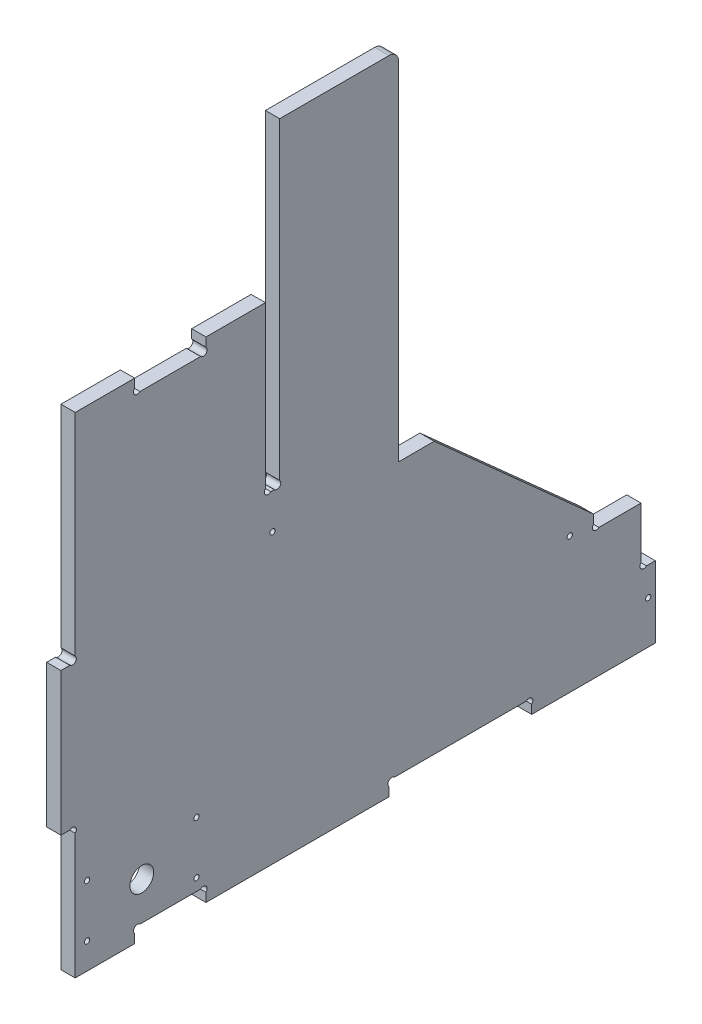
ISO-10303-21;
HEADER;
FILE_DESCRIPTION(('STEP AP214'),'2;1');
FILE_NAME('part.step','',(''),(''),'','','');
FILE_SCHEMA(('AUTOMOTIVE_DESIGN { 1 0 10303 214 1 1 1 1 }'));
ENDSEC;
DATA;
#1=APPLICATION_CONTEXT('core data for automotive mechanical design processes');
#2=APPLICATION_PROTOCOL_DEFINITION('international standard','automotive_design',2000,#1);
#3=PRODUCT_CONTEXT('',#1,'mechanical');
#4=PRODUCT('Part','Part','',(#3));
#5=PRODUCT_RELATED_PRODUCT_CATEGORY('part','',(#4));
#6=PRODUCT_DEFINITION_FORMATION('','',#4);
#7=PRODUCT_DEFINITION_CONTEXT('part definition',#1,'design');
#8=PRODUCT_DEFINITION('design','',#6,#7);
#9=PRODUCT_DEFINITION_SHAPE('','',#8);
#10=(LENGTH_UNIT() NAMED_UNIT(*) SI_UNIT(.MILLI.,.METRE.));
#11=(NAMED_UNIT(*) PLANE_ANGLE_UNIT() SI_UNIT($,.RADIAN.));
#12=(NAMED_UNIT(*) SI_UNIT($,.STERADIAN.) SOLID_ANGLE_UNIT());
#13=UNCERTAINTY_MEASURE_WITH_UNIT(LENGTH_MEASURE(1.E-05),#10,'distance_accuracy_value','');
#14=(GEOMETRIC_REPRESENTATION_CONTEXT(3) GLOBAL_UNCERTAINTY_ASSIGNED_CONTEXT((#13)) GLOBAL_UNIT_ASSIGNED_CONTEXT((#10,
#11,#12)) REPRESENTATION_CONTEXT('',''));
#15=CARTESIAN_POINT('',(0.,0.,0.));
#16=DIRECTION('',(0.,0.,1.));
#17=DIRECTION('',(1.,0.,0.));
#18=AXIS2_PLACEMENT_3D('',#15,#16,#17);
#19=CARTESIAN_POINT('',(6.,31.1313708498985,-245.131370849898));
#20=DIRECTION('',(1.,0.,0.));
#21=DIRECTION('',(0.,0.,-1.));
#22=AXIS2_PLACEMENT_3D('',#19,#20,#21);
#23=PLANE('',#22);
#24=CARTESIAN_POINT('',(6.,18.,-247.));
#25=DIRECTION('',(1.,0.,0.));
#26=DIRECTION('',(0.,0.,-1.));
#27=AXIS2_PLACEMENT_3D('',#24,#25,#26);
#28=CIRCLE('',#27,1.09999999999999);
#29=CARTESIAN_POINT('',(6.,18.,-248.1));
#30=VERTEX_POINT('',#29);
#31=EDGE_CURVE('E723',#30,#30,#28,.T.);
#32=ORIENTED_EDGE('',*,*,#31,.F.);
#33=EDGE_LOOP('',(#32));
#34=FACE_BOUND('',#33,.T.);
#35=CARTESIAN_POINT('',(6.,11.,-57.));
#36=DIRECTION('',(1.,0.,0.));
#37=DIRECTION('',(0.,0.,1.));
#38=AXIS2_PLACEMENT_3D('',#35,#36,#37);
#39=CIRCLE('',#38,1.10000000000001);
#40=CARTESIAN_POINT('',(6.,11.,-55.9));
#41=VERTEX_POINT('',#40);
#42=EDGE_CURVE('E735',#41,#41,#39,.T.);
#43=ORIENTED_EDGE('',*,*,#42,.F.);
#44=EDGE_LOOP('',(#43));
#45=FACE_BOUND('',#44,.T.);
#46=CARTESIAN_POINT('',(6.,32.9999999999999,-57.));
#47=DIRECTION('',(1.,0.,0.));
#48=DIRECTION('',(0.,0.,-1.));
#49=AXIS2_PLACEMENT_3D('',#46,#47,#48);
#50=CIRCLE('',#49,1.10000000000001);
#51=CARTESIAN_POINT('',(6.,32.9999999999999,-58.1));
#52=VERTEX_POINT('',#51);
#53=EDGE_CURVE('E747',#52,#52,#50,.T.);
#54=ORIENTED_EDGE('',*,*,#53,.F.);
#55=EDGE_LOOP('',(#54));
#56=FACE_BOUND('',#55,.T.);
#57=CARTESIAN_POINT('',(6.,121.,-89.));
#58=DIRECTION('',(1.,0.,0.));
#59=DIRECTION('',(0.,0.,-1.));
#60=AXIS2_PLACEMENT_3D('',#57,#58,#59);
#61=CIRCLE('',#60,1.10000000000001);
#62=CARTESIAN_POINT('',(6.,121.,-90.1));
#63=VERTEX_POINT('',#62);
#64=EDGE_CURVE('E350',#63,#63,#61,.T.);
#65=ORIENTED_EDGE('',*,*,#64,.F.);
#66=EDGE_LOOP('',(#65));
#67=FACE_BOUND('',#66,.T.);
#68=DIRECTION('',(0.,0.,1.));
#69=VECTOR('',#68,1.);
#70=CARTESIAN_POINT('',(6.,54.,-226.262741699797));
#71=LINE('',#70,#69);
#72=CARTESIAN_POINT('',(6.,54.,-244.));
#73=VERTEX_POINT('',#72);
#74=CARTESIAN_POINT('',(6.,54.,-226.262741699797));
#75=VERTEX_POINT('',#74);
#76=EDGE_CURVE('E433',#73,#75,#71,.T.);
#77=ORIENTED_EDGE('',*,*,#76,.T.);
#78=CARTESIAN_POINT('',(6.,55.1313708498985,-225.131370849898));
#79=DIRECTION('',(-1.,0.,0.));
#80=DIRECTION('',(0.,0.,-1.));
#81=AXIS2_PLACEMENT_3D('',#78,#79,#80);
#82=CIRCLE('',#81,1.59999999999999);
#83=CARTESIAN_POINT('',(6.,56.2627416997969,-224.));
#84=VERTEX_POINT('',#83);
#85=EDGE_CURVE('E201',#75,#84,#82,.T.);
#86=ORIENTED_EDGE('',*,*,#85,.T.);
#87=DIRECTION('',(0.,1.,0.));
#88=VECTOR('',#87,1.);
#89=CARTESIAN_POINT('',(6.,60.,-224.));
#90=LINE('',#89,#88);
#91=CARTESIAN_POINT('',(6.,60.,-224.));
#92=VERTEX_POINT('',#91);
#93=EDGE_CURVE('E556',#84,#92,#90,.T.);
#94=ORIENTED_EDGE('',*,*,#93,.T.);
#95=DIRECTION('',(0.,0.667119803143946,0.744950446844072));
#96=VECTOR('',#95,1.);
#97=CARTESIAN_POINT('',(6.,60.,-224.));
#98=LINE('',#97,#96);
#99=CARTESIAN_POINT('',(6.,120.,-157.));
#100=VERTEX_POINT('',#99);
#101=EDGE_CURVE('E575',#92,#100,#98,.T.);
#102=ORIENTED_EDGE('',*,*,#101,.T.);
#103=DIRECTION('',(0.,0.,1.));
#104=VECTOR('',#103,1.);
#105=CARTESIAN_POINT('',(6.,120.,-142.));
#106=LINE('',#105,#104);
#107=CARTESIAN_POINT('',(6.,120.,-142.));
#108=VERTEX_POINT('',#107);
#109=EDGE_CURVE('E572',#100,#108,#106,.T.);
#110=ORIENTED_EDGE('',*,*,#109,.T.);
#111=DIRECTION('',(0.,1.,0.));
#112=VECTOR('',#111,1.);
#113=CARTESIAN_POINT('',(6.,266.,-142.));
#114=LINE('',#113,#112);
#115=CARTESIAN_POINT('',(6.,266.,-142.));
#116=VERTEX_POINT('',#115);
#117=EDGE_CURVE('E574',#108,#116,#114,.T.);
#118=ORIENTED_EDGE('',*,*,#117,.T.);
#119=CARTESIAN_POINT('',(6.,266.,-138.));
#120=DIRECTION('',(1.,0.,0.));
#121=DIRECTION('',(0.,0.,1.));
#122=AXIS2_PLACEMENT_3D('',#119,#120,#121);
#123=CIRCLE('',#122,4.);
#124=CARTESIAN_POINT('',(6.,270.,-138.));
#125=VERTEX_POINT('',#124);
#126=EDGE_CURVE('E577',#116,#125,#123,.T.);
#127=ORIENTED_EDGE('',*,*,#126,.T.);
#128=DIRECTION('',(0.,0.,1.));
#129=VECTOR('',#128,1.);
#130=CARTESIAN_POINT('',(6.,270.,-92.));
#131=LINE('',#130,#129);
#132=CARTESIAN_POINT('',(6.,270.,-92.));
#133=VERTEX_POINT('',#132);
#134=EDGE_CURVE('E583',#125,#133,#131,.T.);
#135=ORIENTED_EDGE('',*,*,#134,.T.);
#136=DIRECTION('',(0.,-1.,0.));
#137=VECTOR('',#136,1.);
#138=CARTESIAN_POINT('',(6.,138.262741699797,-92.0000000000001));
#139=LINE('',#138,#137);
#140=CARTESIAN_POINT('',(6.,138.262741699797,-92.0000000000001));
#141=VERTEX_POINT('',#140);
#142=EDGE_CURVE('E585',#133,#141,#139,.T.);
#143=ORIENTED_EDGE('',*,*,#142,.T.);
#144=CARTESIAN_POINT('',(6.,137.131370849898,-90.8686291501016));
#145=DIRECTION('',(-1.,0.,0.));
#146=DIRECTION('',(0.,0.,1.));
#147=AXIS2_PLACEMENT_3D('',#144,#145,#146);
#148=CIRCLE('',#147,1.60000000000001);
#149=CARTESIAN_POINT('',(6.,136.,-89.7372583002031));
#150=VERTEX_POINT('',#149);
#151=EDGE_CURVE('E587',#141,#150,#148,.T.);
#152=ORIENTED_EDGE('',*,*,#151,.T.);
#153=DIRECTION('',(0.,0.,1.));
#154=VECTOR('',#153,1.);
#155=CARTESIAN_POINT('',(6.,136.,-88.2627416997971));
#156=LINE('',#155,#154);
#157=CARTESIAN_POINT('',(6.,136.,-88.2627416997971));
#158=VERTEX_POINT('',#157);
#159=EDGE_CURVE('E589',#150,#158,#156,.T.);
#160=ORIENTED_EDGE('',*,*,#159,.T.);
#161=CARTESIAN_POINT('',(6.,137.131370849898,-87.1313708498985));
#162=DIRECTION('',(-1.,0.,0.));
#163=DIRECTION('',(0.,0.,-1.));
#164=AXIS2_PLACEMENT_3D('',#161,#162,#163);
#165=CIRCLE('',#164,1.60000000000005);
#166=CARTESIAN_POINT('',(6.,138.262741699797,-86.));
#167=VERTEX_POINT('',#166);
#168=EDGE_CURVE('E591',#158,#167,#165,.T.);
#169=ORIENTED_EDGE('',*,*,#168,.T.);
#170=DIRECTION('',(0.,1.,0.));
#171=VECTOR('',#170,1.);
#172=CARTESIAN_POINT('',(6.,206.,-86.));
#173=LINE('',#172,#171);
#174=CARTESIAN_POINT('',(6.,206.,-86.));
#175=VERTEX_POINT('',#174);
#176=EDGE_CURVE('E593',#167,#175,#173,.T.);
#177=ORIENTED_EDGE('',*,*,#176,.T.);
#178=DIRECTION('',(0.,0.,1.));
#179=VECTOR('',#178,1.);
#180=CARTESIAN_POINT('',(6.,206.,-61.));
#181=LINE('',#180,#179);
#182=CARTESIAN_POINT('',(6.,206.,-61.));
#183=VERTEX_POINT('',#182);
#184=EDGE_CURVE('E595',#175,#183,#181,.T.);
#185=ORIENTED_EDGE('',*,*,#184,.T.);
#186=DIRECTION('',(0.,-1.,0.));
#187=VECTOR('',#186,1.);
#188=CARTESIAN_POINT('',(6.,202.262741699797,-61.));
#189=LINE('',#188,#187);
#190=CARTESIAN_POINT('',(6.,202.262741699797,-61.));
#191=VERTEX_POINT('',#190);
#192=EDGE_CURVE('E597',#183,#191,#189,.T.);
#193=ORIENTED_EDGE('',*,*,#192,.T.);
#194=CARTESIAN_POINT('',(6.,201.131370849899,-59.8686291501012));
#195=DIRECTION('',(-1.,0.,0.));
#196=DIRECTION('',(0.,0.,-1.));
#197=AXIS2_PLACEMENT_3D('',#194,#195,#196);
#198=CIRCLE('',#197,1.60000000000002);
#199=CARTESIAN_POINT('',(6.,200.,-58.737258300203));
#200=VERTEX_POINT('',#199);
#201=EDGE_CURVE('E599',#191,#200,#198,.T.);
#202=ORIENTED_EDGE('',*,*,#201,.T.);
#203=DIRECTION('',(0.,0.,1.));
#204=VECTOR('',#203,1.);
#205=CARTESIAN_POINT('',(6.,200.,-33.262741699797));
#206=LINE('',#205,#204);
#207=CARTESIAN_POINT('',(6.,200.,-33.262741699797));
#208=VERTEX_POINT('',#207);
#209=EDGE_CURVE('E601',#200,#208,#206,.T.);
#210=ORIENTED_EDGE('',*,*,#209,.T.);
#211=CARTESIAN_POINT('',(6.,201.131370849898,-32.1313708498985));
#212=DIRECTION('',(-1.,0.,0.));
#213=DIRECTION('',(0.,0.,1.));
#214=AXIS2_PLACEMENT_3D('',#211,#212,#213);
#215=CIRCLE('',#214,1.60000000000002);
#216=CARTESIAN_POINT('',(6.,202.262741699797,-31.));
#217=VERTEX_POINT('',#216);
#218=EDGE_CURVE('E603',#208,#217,#215,.T.);
#219=ORIENTED_EDGE('',*,*,#218,.T.);
#220=DIRECTION('',(0.,1.,0.));
#221=VECTOR('',#220,1.);
#222=CARTESIAN_POINT('',(6.,202.262741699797,-31.));
#223=LINE('',#222,#221);
#224=CARTESIAN_POINT('',(6.,206.,-31.));
#225=VERTEX_POINT('',#224);
#226=EDGE_CURVE('E605',#217,#225,#223,.T.);
#227=ORIENTED_EDGE('',*,*,#226,.T.);
#228=DIRECTION('',(0.,0.,1.));
#229=VECTOR('',#228,1.);
#230=CARTESIAN_POINT('',(6.,206.,-6.));
#231=LINE('',#230,#229);
#232=CARTESIAN_POINT('',(6.,206.,-6.));
#233=VERTEX_POINT('',#232);
#234=EDGE_CURVE('E607',#225,#233,#231,.T.);
#235=ORIENTED_EDGE('',*,*,#234,.T.);
#236=DIRECTION('',(0.,-1.,0.));
#237=VECTOR('',#236,1.);
#238=CARTESIAN_POINT('',(6.,117.262741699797,-6.));
#239=LINE('',#238,#237);
#240=CARTESIAN_POINT('',(6.,117.262741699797,-6.));
#241=VERTEX_POINT('',#240);
#242=EDGE_CURVE('E609',#233,#241,#239,.T.);
#243=ORIENTED_EDGE('',*,*,#242,.T.);
#244=CARTESIAN_POINT('',(6.,116.131370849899,-4.86862915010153));
#245=DIRECTION('',(-1.,0.,0.));
#246=DIRECTION('',(0.,0.,1.));
#247=AXIS2_PLACEMENT_3D('',#244,#245,#246);
#248=CIRCLE('',#247,1.60000000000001);
#249=CARTESIAN_POINT('',(6.,115.,-3.73725830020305));
#250=VERTEX_POINT('',#249);
#251=EDGE_CURVE('E611',#241,#250,#248,.T.);
#252=ORIENTED_EDGE('',*,*,#251,.T.);
#253=DIRECTION('',(0.,0.,1.));
#254=VECTOR('',#253,1.);
#255=CARTESIAN_POINT('',(6.,115.,-3.73725830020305));
#256=LINE('',#255,#254);
#257=CARTESIAN_POINT('',(6.,115.,0.));
#258=VERTEX_POINT('',#257);
#259=EDGE_CURVE('E613',#250,#258,#256,.T.);
#260=ORIENTED_EDGE('',*,*,#259,.T.);
#261=DIRECTION('',(0.,-1.,0.));
#262=VECTOR('',#261,1.);
#263=CARTESIAN_POINT('',(6.,115.,0.));
#264=LINE('',#263,#262);
#265=CARTESIAN_POINT('',(6.,55.,0.));
#266=VERTEX_POINT('',#265);
#267=EDGE_CURVE('E615',#258,#266,#264,.T.);
#268=ORIENTED_EDGE('',*,*,#267,.T.);
#269=DIRECTION('',(0.,0.,-1.));
#270=VECTOR('',#269,1.);
#271=CARTESIAN_POINT('',(6.,55.,0.));
#272=LINE('',#271,#270);
#273=CARTESIAN_POINT('',(6.,55.,-3.73725830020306));
#274=VERTEX_POINT('',#273);
#275=EDGE_CURVE('E617',#266,#274,#272,.T.);
#276=ORIENTED_EDGE('',*,*,#275,.T.);
#277=CARTESIAN_POINT('',(6.,53.8686291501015,-4.86862915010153));
#278=DIRECTION('',(-1.,0.,0.));
#279=DIRECTION('',(0.,0.,-1.));
#280=AXIS2_PLACEMENT_3D('',#277,#278,#279);
#281=CIRCLE('',#280,1.6);
#282=CARTESIAN_POINT('',(6.,52.737258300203,-6.));
#283=VERTEX_POINT('',#282);
#284=EDGE_CURVE('E619',#274,#283,#281,.T.);
#285=ORIENTED_EDGE('',*,*,#284,.T.);
#286=DIRECTION('',(0.,-1.,0.));
#287=VECTOR('',#286,1.);
#288=CARTESIAN_POINT('',(6.,52.737258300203,-6.));
#289=LINE('',#288,#287);
#290=CARTESIAN_POINT('',(6.,0.,-6.));
#291=VERTEX_POINT('',#290);
#292=EDGE_CURVE('E621',#283,#291,#289,.T.);
#293=ORIENTED_EDGE('',*,*,#292,.T.);
#294=DIRECTION('',(0.,0.,-1.));
#295=VECTOR('',#294,1.);
#296=CARTESIAN_POINT('',(6.,0.,-6.));
#297=LINE('',#296,#295);
#298=CARTESIAN_POINT('',(6.,0.,-31.));
#299=VERTEX_POINT('',#298);
#300=EDGE_CURVE('E623',#291,#299,#297,.T.);
#301=ORIENTED_EDGE('',*,*,#300,.T.);
#302=DIRECTION('',(0.,1.,0.));
#303=VECTOR('',#302,1.);
#304=CARTESIAN_POINT('',(6.,3.73725830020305,-31.));
#305=LINE('',#304,#303);
#306=CARTESIAN_POINT('',(6.,3.73725830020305,-31.));
#307=VERTEX_POINT('',#306);
#308=EDGE_CURVE('E625',#299,#307,#305,.T.);
#309=ORIENTED_EDGE('',*,*,#308,.T.);
#310=CARTESIAN_POINT('',(6.,4.86862915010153,-32.1313708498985));
#311=DIRECTION('',(-1.,0.,0.));
#312=DIRECTION('',(0.,0.,-1.));
#313=AXIS2_PLACEMENT_3D('',#310,#311,#312);
#314=CIRCLE('',#313,1.60000000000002);
#315=CARTESIAN_POINT('',(6.,6.00000000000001,-33.262741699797));
#316=VERTEX_POINT('',#315);
#317=EDGE_CURVE('E627',#307,#316,#314,.T.);
#318=ORIENTED_EDGE('',*,*,#317,.T.);
#319=DIRECTION('',(0.,0.,-1.));
#320=VECTOR('',#319,1.);
#321=CARTESIAN_POINT('',(6.,6.00000000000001,-33.262741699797));
#322=LINE('',#321,#320);
#323=CARTESIAN_POINT('',(6.,6.00000000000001,-58.737258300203));
#324=VERTEX_POINT('',#323);
#325=EDGE_CURVE('E629',#316,#324,#322,.T.);
#326=ORIENTED_EDGE('',*,*,#325,.T.);
#327=CARTESIAN_POINT('',(6.,4.86862915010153,-59.8686291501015));
#328=DIRECTION('',(-1.,0.,0.));
#329=DIRECTION('',(0.,0.,1.));
#330=AXIS2_PLACEMENT_3D('',#327,#328,#329);
#331=CIRCLE('',#330,1.60000000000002);
#332=CARTESIAN_POINT('',(6.,3.73725830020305,-61.));
#333=VERTEX_POINT('',#332);
#334=EDGE_CURVE('E631',#324,#333,#331,.T.);
#335=ORIENTED_EDGE('',*,*,#334,.T.);
#336=DIRECTION('',(0.,-1.,0.));
#337=VECTOR('',#336,1.);
#338=CARTESIAN_POINT('',(6.,3.73725830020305,-61.));
#339=LINE('',#338,#337);
#340=CARTESIAN_POINT('',(6.,0.,-61.));
#341=VERTEX_POINT('',#340);
#342=EDGE_CURVE('E633',#333,#341,#339,.T.);
#343=ORIENTED_EDGE('',*,*,#342,.T.);
#344=DIRECTION('',(0.,0.,-1.));
#345=VECTOR('',#344,1.);
#346=CARTESIAN_POINT('',(6.,0.,-61.));
#347=LINE('',#346,#345);
#348=CARTESIAN_POINT('',(6.,0.,-138.));
#349=VERTEX_POINT('',#348);
#350=EDGE_CURVE('E635',#341,#349,#347,.T.);
#351=ORIENTED_EDGE('',*,*,#350,.T.);
#352=DIRECTION('',(0.,1.,0.));
#353=VECTOR('',#352,1.);
#354=CARTESIAN_POINT('',(6.,3.73725830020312,-138.));
#355=LINE('',#354,#353);
#356=CARTESIAN_POINT('',(6.,3.73725830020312,-138.));
#357=VERTEX_POINT('',#356);
#358=EDGE_CURVE('E637',#349,#357,#355,.T.);
#359=ORIENTED_EDGE('',*,*,#358,.T.);
#360=CARTESIAN_POINT('',(6.,4.86862915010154,-139.131370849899));
#361=DIRECTION('',(-1.,0.,0.));
#362=DIRECTION('',(0.,0.,1.));
#363=AXIS2_PLACEMENT_3D('',#360,#361,#362);
#364=CIRCLE('',#363,1.59999999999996);
#365=CARTESIAN_POINT('',(6.,5.99999999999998,-140.262741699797));
#366=VERTEX_POINT('',#365);
#367=EDGE_CURVE('E639',#357,#366,#364,.T.);
#368=ORIENTED_EDGE('',*,*,#367,.T.);
#369=DIRECTION('',(0.,0.,-1.));
#370=VECTOR('',#369,1.);
#371=CARTESIAN_POINT('',(6.,5.99999999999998,-140.262741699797));
#372=LINE('',#371,#370);
#373=CARTESIAN_POINT('',(6.,5.99999999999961,-195.737258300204));
#374=VERTEX_POINT('',#373);
#375=EDGE_CURVE('E641',#366,#374,#372,.T.);
#376=ORIENTED_EDGE('',*,*,#375,.T.);
#377=CARTESIAN_POINT('',(6.,4.86862915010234,-196.868629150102));
#378=DIRECTION('',(-1.,0.,0.));
#379=DIRECTION('',(0.,0.,-1.));
#380=AXIS2_PLACEMENT_3D('',#377,#378,#379);
#381=CIRCLE('',#380,1.59999999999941);
#382=CARTESIAN_POINT('',(6.,3.73725830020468,-198.));
#383=VERTEX_POINT('',#382);
#384=EDGE_CURVE('E643',#374,#383,#381,.T.);
#385=ORIENTED_EDGE('',*,*,#384,.T.);
#386=DIRECTION('',(0.,-1.,0.));
#387=VECTOR('',#386,1.);
#388=CARTESIAN_POINT('',(6.,3.73725830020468,-198.));
#389=LINE('',#388,#387);
#390=CARTESIAN_POINT('',(6.,0.,-198.));
#391=VERTEX_POINT('',#390);
#392=EDGE_CURVE('E645',#383,#391,#389,.T.);
#393=ORIENTED_EDGE('',*,*,#392,.T.);
#394=DIRECTION('',(0.,0.,-1.));
#395=VECTOR('',#394,1.);
#396=CARTESIAN_POINT('',(6.,0.,-250.));
#397=LINE('',#396,#395);
#398=CARTESIAN_POINT('',(6.,0.,-250.));
#399=VERTEX_POINT('',#398);
#400=EDGE_CURVE('E647',#391,#399,#397,.T.);
#401=ORIENTED_EDGE('',*,*,#400,.T.);
#402=DIRECTION('',(0.,1.,0.));
#403=VECTOR('',#402,1.);
#404=CARTESIAN_POINT('',(6.,30.,-250.));
#405=LINE('',#404,#403);
#406=CARTESIAN_POINT('',(6.,30.,-250.));
#407=VERTEX_POINT('',#406);
#408=EDGE_CURVE('E328',#399,#407,#405,.T.);
#409=ORIENTED_EDGE('',*,*,#408,.T.);
#410=DIRECTION('',(0.,0.,1.));
#411=VECTOR('',#410,1.);
#412=CARTESIAN_POINT('',(6.,30.,-246.262741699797));
#413=LINE('',#412,#411);
#414=CARTESIAN_POINT('',(6.,30.,-246.262741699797));
#415=VERTEX_POINT('',#414);
#416=EDGE_CURVE('E322',#407,#415,#413,.T.);
#417=ORIENTED_EDGE('',*,*,#416,.T.);
#418=CARTESIAN_POINT('',(6.,31.1313708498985,-245.131370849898));
#419=DIRECTION('',(-1.,0.,0.));
#420=DIRECTION('',(0.,0.,-1.));
#421=AXIS2_PLACEMENT_3D('',#418,#419,#420);
#422=CIRCLE('',#421,1.60000000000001);
#423=CARTESIAN_POINT('',(6.,32.262741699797,-244.));
#424=VERTEX_POINT('',#423);
#425=EDGE_CURVE('E326',#415,#424,#422,.T.);
#426=ORIENTED_EDGE('',*,*,#425,.T.);
#427=DIRECTION('',(0.,1.,0.));
#428=VECTOR('',#427,1.);
#429=CARTESIAN_POINT('',(6.,54.,-244.));
#430=LINE('',#429,#428);
#431=EDGE_CURVE('E50',#424,#73,#430,.T.);
#432=ORIENTED_EDGE('',*,*,#431,.T.);
#433=EDGE_LOOP('',(#77,#86,#94,#102,#110,#118,#127,#135,#143,#152,#160,#169,#177,#185,#193,#202,
#210,#219,#227,#235,#243,#252,#260,#268,#276,#285,#293,#301,#309,#318,#326,#335,#343,#351,#359,
#368,#376,#385,#393,#401,#409,#417,#426,#432));
#434=FACE_BOUND('',#433,.T.);
#435=CARTESIAN_POINT('',(6.,11.,-11.));
#436=DIRECTION('',(1.,0.,0.));
#437=DIRECTION('',(0.,0.,-1.));
#438=AXIS2_PLACEMENT_3D('',#435,#436,#437);
#439=CIRCLE('',#438,1.1);
#440=CARTESIAN_POINT('',(6.,11.,-12.1));
#441=VERTEX_POINT('',#440);
#442=EDGE_CURVE('E753',#441,#441,#439,.T.);
#443=ORIENTED_EDGE('',*,*,#442,.F.);
#444=EDGE_LOOP('',(#443));
#445=FACE_BOUND('',#444,.T.);
#446=CARTESIAN_POINT('',(6.,22.,-34.));
#447=DIRECTION('',(1.,0.,0.));
#448=DIRECTION('',(0.,0.,-1.));
#449=AXIS2_PLACEMENT_3D('',#446,#447,#448);
#450=CIRCLE('',#449,5.);
#451=CARTESIAN_POINT('',(6.,22.,-39.));
#452=VERTEX_POINT('',#451);
#453=EDGE_CURVE('E741',#452,#452,#450,.T.);
#454=ORIENTED_EDGE('',*,*,#453,.F.);
#455=EDGE_LOOP('',(#454));
#456=FACE_BOUND('',#455,.T.);
#457=CARTESIAN_POINT('',(6.,32.9999999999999,-11.));
#458=DIRECTION('',(1.,0.,0.));
#459=DIRECTION('',(0.,0.,1.));
#460=AXIS2_PLACEMENT_3D('',#457,#458,#459);
#461=CIRCLE('',#460,1.10000000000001);
#462=CARTESIAN_POINT('',(6.,32.9999999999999,-9.89999999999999));
#463=VERTEX_POINT('',#462);
#464=EDGE_CURVE('E729',#463,#463,#461,.T.);
#465=ORIENTED_EDGE('',*,*,#464,.F.);
#466=EDGE_LOOP('',(#465));
#467=FACE_BOUND('',#466,.T.);
#468=CARTESIAN_POINT('',(6.,57.,-214.));
#469=DIRECTION('',(1.,0.,0.));
#470=DIRECTION('',(0.,0.,-1.));
#471=AXIS2_PLACEMENT_3D('',#468,#469,#470);
#472=CIRCLE('',#471,1.09999999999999);
#473=CARTESIAN_POINT('',(6.,57.,-215.1));
#474=VERTEX_POINT('',#473);
#475=EDGE_CURVE('E714',#474,#474,#472,.T.);
#476=ORIENTED_EDGE('',*,*,#475,.F.);
#477=EDGE_LOOP('',(#476));
#478=FACE_BOUND('',#477,.T.);
#479=ADVANCED_FACE('F33',(#34,#45,#56,#67,#434,#445,#456,#467,#478),#23,.T.);
#480=CARTESIAN_POINT('',(0.,31.1313708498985,-245.131370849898));
#481=DIRECTION('',(1.,0.,0.));
#482=DIRECTION('',(0.,0.,-1.));
#483=AXIS2_PLACEMENT_3D('',#480,#481,#482);
#484=PLANE('',#483);
#485=DIRECTION('',(0.,0.,1.));
#486=VECTOR('',#485,1.);
#487=CARTESIAN_POINT('',(0.,54.,-226.262741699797));
#488=LINE('',#487,#486);
#489=CARTESIAN_POINT('',(0.,54.,-244.));
#490=VERTEX_POINT('',#489);
#491=CARTESIAN_POINT('',(0.,54.,-226.262741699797));
#492=VERTEX_POINT('',#491);
#493=EDGE_CURVE('E346',#490,#492,#488,.T.);
#494=ORIENTED_EDGE('',*,*,#493,.F.);
#495=DIRECTION('',(0.,1.,0.));
#496=VECTOR('',#495,1.);
#497=CARTESIAN_POINT('',(0.,54.,-244.));
#498=LINE('',#497,#496);
#499=CARTESIAN_POINT('',(0.,32.262741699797,-244.));
#500=VERTEX_POINT('',#499);
#501=EDGE_CURVE('E193',#500,#490,#498,.T.);
#502=ORIENTED_EDGE('',*,*,#501,.F.);
#503=CARTESIAN_POINT('',(0.,31.1313708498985,-245.131370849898));
#504=DIRECTION('',(-1.,0.,0.));
#505=DIRECTION('',(0.,0.,-1.));
#506=AXIS2_PLACEMENT_3D('',#503,#504,#505);
#507=CIRCLE('',#506,1.60000000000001);
#508=CARTESIAN_POINT('',(0.,30.,-246.262741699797));
#509=VERTEX_POINT('',#508);
#510=EDGE_CURVE('E187',#509,#500,#507,.T.);
#511=ORIENTED_EDGE('',*,*,#510,.F.);
#512=DIRECTION('',(0.,0.,1.));
#513=VECTOR('',#512,1.);
#514=CARTESIAN_POINT('',(0.,30.,-246.262741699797));
#515=LINE('',#514,#513);
#516=CARTESIAN_POINT('',(0.,30.,-250.));
#517=VERTEX_POINT('',#516);
#518=EDGE_CURVE('E336',#517,#509,#515,.T.);
#519=ORIENTED_EDGE('',*,*,#518,.F.);
#520=DIRECTION('',(0.,1.,0.));
#521=VECTOR('',#520,1.);
#522=CARTESIAN_POINT('',(0.,30.,-250.));
#523=LINE('',#522,#521);
#524=CARTESIAN_POINT('',(0.,0.,-250.));
#525=VERTEX_POINT('',#524);
#526=EDGE_CURVE('E428',#525,#517,#523,.T.);
#527=ORIENTED_EDGE('',*,*,#526,.F.);
#528=DIRECTION('',(0.,0.,-1.));
#529=VECTOR('',#528,1.);
#530=CARTESIAN_POINT('',(0.,0.,-250.));
#531=LINE('',#530,#529);
#532=CARTESIAN_POINT('',(0.,0.,-198.));
#533=VERTEX_POINT('',#532);
#534=EDGE_CURVE('E426',#533,#525,#531,.T.);
#535=ORIENTED_EDGE('',*,*,#534,.F.);
#536=DIRECTION('',(0.,-1.,0.));
#537=VECTOR('',#536,1.);
#538=CARTESIAN_POINT('',(0.,3.73725830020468,-198.));
#539=LINE('',#538,#537);
#540=CARTESIAN_POINT('',(0.,3.73725830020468,-198.));
#541=VERTEX_POINT('',#540);
#542=EDGE_CURVE('E424',#541,#533,#539,.T.);
#543=ORIENTED_EDGE('',*,*,#542,.F.);
#544=CARTESIAN_POINT('',(0.,4.86862915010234,-196.868629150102));
#545=DIRECTION('',(-1.,0.,0.));
#546=DIRECTION('',(0.,0.,-1.));
#547=AXIS2_PLACEMENT_3D('',#544,#545,#546);
#548=CIRCLE('',#547,1.59999999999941);
#549=CARTESIAN_POINT('',(0.,5.99999999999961,-195.737258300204));
#550=VERTEX_POINT('',#549);
#551=EDGE_CURVE('E422',#550,#541,#548,.T.);
#552=ORIENTED_EDGE('',*,*,#551,.F.);
#553=DIRECTION('',(0.,0.,-1.));
#554=VECTOR('',#553,1.);
#555=CARTESIAN_POINT('',(0.,5.99999999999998,-140.262741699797));
#556=LINE('',#555,#554);
#557=CARTESIAN_POINT('',(0.,5.99999999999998,-140.262741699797));
#558=VERTEX_POINT('',#557);
#559=EDGE_CURVE('E420',#558,#550,#556,.T.);
#560=ORIENTED_EDGE('',*,*,#559,.F.);
#561=CARTESIAN_POINT('',(0.,4.86862915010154,-139.131370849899));
#562=DIRECTION('',(-1.,0.,0.));
#563=DIRECTION('',(0.,0.,1.));
#564=AXIS2_PLACEMENT_3D('',#561,#562,#563);
#565=CIRCLE('',#564,1.59999999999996);
#566=CARTESIAN_POINT('',(0.,3.73725830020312,-138.));
#567=VERTEX_POINT('',#566);
#568=EDGE_CURVE('E418',#567,#558,#565,.T.);
#569=ORIENTED_EDGE('',*,*,#568,.F.);
#570=DIRECTION('',(0.,1.,0.));
#571=VECTOR('',#570,1.);
#572=CARTESIAN_POINT('',(0.,3.73725830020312,-138.));
#573=LINE('',#572,#571);
#574=CARTESIAN_POINT('',(0.,0.,-138.));
#575=VERTEX_POINT('',#574);
#576=EDGE_CURVE('E416',#575,#567,#573,.T.);
#577=ORIENTED_EDGE('',*,*,#576,.F.);
#578=DIRECTION('',(0.,0.,-1.));
#579=VECTOR('',#578,1.);
#580=CARTESIAN_POINT('',(0.,0.,-61.));
#581=LINE('',#580,#579);
#582=CARTESIAN_POINT('',(0.,0.,-61.));
#583=VERTEX_POINT('',#582);
#584=EDGE_CURVE('E414',#583,#575,#581,.T.);
#585=ORIENTED_EDGE('',*,*,#584,.F.);
#586=DIRECTION('',(0.,-1.,0.));
#587=VECTOR('',#586,1.);
#588=CARTESIAN_POINT('',(0.,3.73725830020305,-61.));
#589=LINE('',#588,#587);
#590=CARTESIAN_POINT('',(0.,3.73725830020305,-61.));
#591=VERTEX_POINT('',#590);
#592=EDGE_CURVE('E412',#591,#583,#589,.T.);
#593=ORIENTED_EDGE('',*,*,#592,.F.);
#594=CARTESIAN_POINT('',(0.,4.86862915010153,-59.8686291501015));
#595=DIRECTION('',(-1.,0.,0.));
#596=DIRECTION('',(0.,0.,1.));
#597=AXIS2_PLACEMENT_3D('',#594,#595,#596);
#598=CIRCLE('',#597,1.60000000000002);
#599=CARTESIAN_POINT('',(0.,6.00000000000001,-58.737258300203));
#600=VERTEX_POINT('',#599);
#601=EDGE_CURVE('E410',#600,#591,#598,.T.);
#602=ORIENTED_EDGE('',*,*,#601,.F.);
#603=DIRECTION('',(0.,0.,-1.));
#604=VECTOR('',#603,1.);
#605=CARTESIAN_POINT('',(0.,6.00000000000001,-33.262741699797));
#606=LINE('',#605,#604);
#607=CARTESIAN_POINT('',(0.,6.00000000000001,-33.262741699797));
#608=VERTEX_POINT('',#607);
#609=EDGE_CURVE('E408',#608,#600,#606,.T.);
#610=ORIENTED_EDGE('',*,*,#609,.F.);
#611=CARTESIAN_POINT('',(0.,4.86862915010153,-32.1313708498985));
#612=DIRECTION('',(-1.,0.,0.));
#613=DIRECTION('',(0.,0.,-1.));
#614=AXIS2_PLACEMENT_3D('',#611,#612,#613);
#615=CIRCLE('',#614,1.60000000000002);
#616=CARTESIAN_POINT('',(0.,3.73725830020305,-31.));
#617=VERTEX_POINT('',#616);
#618=EDGE_CURVE('E406',#617,#608,#615,.T.);
#619=ORIENTED_EDGE('',*,*,#618,.F.);
#620=DIRECTION('',(0.,1.,0.));
#621=VECTOR('',#620,1.);
#622=CARTESIAN_POINT('',(0.,3.73725830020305,-31.));
#623=LINE('',#622,#621);
#624=CARTESIAN_POINT('',(0.,0.,-31.));
#625=VERTEX_POINT('',#624);
#626=EDGE_CURVE('E404',#625,#617,#623,.T.);
#627=ORIENTED_EDGE('',*,*,#626,.F.);
#628=DIRECTION('',(0.,0.,-1.));
#629=VECTOR('',#628,1.);
#630=CARTESIAN_POINT('',(0.,0.,-6.));
#631=LINE('',#630,#629);
#632=CARTESIAN_POINT('',(0.,0.,-6.));
#633=VERTEX_POINT('',#632);
#634=EDGE_CURVE('E402',#633,#625,#631,.T.);
#635=ORIENTED_EDGE('',*,*,#634,.F.);
#636=DIRECTION('',(0.,-1.,0.));
#637=VECTOR('',#636,1.);
#638=CARTESIAN_POINT('',(0.,52.737258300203,-6.));
#639=LINE('',#638,#637);
#640=CARTESIAN_POINT('',(0.,52.737258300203,-6.));
#641=VERTEX_POINT('',#640);
#642=EDGE_CURVE('E400',#641,#633,#639,.T.);
#643=ORIENTED_EDGE('',*,*,#642,.F.);
#644=CARTESIAN_POINT('',(0.,53.8686291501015,-4.86862915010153));
#645=DIRECTION('',(-1.,0.,0.));
#646=DIRECTION('',(0.,0.,-1.));
#647=AXIS2_PLACEMENT_3D('',#644,#645,#646);
#648=CIRCLE('',#647,1.6);
#649=CARTESIAN_POINT('',(0.,55.,-3.73725830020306));
#650=VERTEX_POINT('',#649);
#651=EDGE_CURVE('E398',#650,#641,#648,.T.);
#652=ORIENTED_EDGE('',*,*,#651,.F.);
#653=DIRECTION('',(0.,0.,-1.));
#654=VECTOR('',#653,1.);
#655=CARTESIAN_POINT('',(0.,55.,0.));
#656=LINE('',#655,#654);
#657=CARTESIAN_POINT('',(0.,55.,0.));
#658=VERTEX_POINT('',#657);
#659=EDGE_CURVE('E396',#658,#650,#656,.T.);
#660=ORIENTED_EDGE('',*,*,#659,.F.);
#661=DIRECTION('',(0.,-1.,0.));
#662=VECTOR('',#661,1.);
#663=CARTESIAN_POINT('',(0.,115.,0.));
#664=LINE('',#663,#662);
#665=CARTESIAN_POINT('',(0.,115.,0.));
#666=VERTEX_POINT('',#665);
#667=EDGE_CURVE('E394',#666,#658,#664,.T.);
#668=ORIENTED_EDGE('',*,*,#667,.F.);
#669=DIRECTION('',(0.,0.,1.));
#670=VECTOR('',#669,1.);
#671=CARTESIAN_POINT('',(0.,115.,-3.73725830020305));
#672=LINE('',#671,#670);
#673=CARTESIAN_POINT('',(0.,115.,-3.73725830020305));
#674=VERTEX_POINT('',#673);
#675=EDGE_CURVE('E392',#674,#666,#672,.T.);
#676=ORIENTED_EDGE('',*,*,#675,.F.);
#677=CARTESIAN_POINT('',(0.,116.131370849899,-4.86862915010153));
#678=DIRECTION('',(-1.,0.,0.));
#679=DIRECTION('',(0.,0.,1.));
#680=AXIS2_PLACEMENT_3D('',#677,#678,#679);
#681=CIRCLE('',#680,1.60000000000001);
#682=CARTESIAN_POINT('',(0.,117.262741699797,-6.));
#683=VERTEX_POINT('',#682);
#684=EDGE_CURVE('E390',#683,#674,#681,.T.);
#685=ORIENTED_EDGE('',*,*,#684,.F.);
#686=DIRECTION('',(0.,-1.,0.));
#687=VECTOR('',#686,1.);
#688=CARTESIAN_POINT('',(0.,117.262741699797,-6.));
#689=LINE('',#688,#687);
#690=CARTESIAN_POINT('',(0.,206.,-6.));
#691=VERTEX_POINT('',#690);
#692=EDGE_CURVE('E388',#691,#683,#689,.T.);
#693=ORIENTED_EDGE('',*,*,#692,.F.);
#694=DIRECTION('',(0.,0.,1.));
#695=VECTOR('',#694,1.);
#696=CARTESIAN_POINT('',(0.,206.,-6.));
#697=LINE('',#696,#695);
#698=CARTESIAN_POINT('',(0.,206.,-31.));
#699=VERTEX_POINT('',#698);
#700=EDGE_CURVE('E386',#699,#691,#697,.T.);
#701=ORIENTED_EDGE('',*,*,#700,.F.);
#702=DIRECTION('',(0.,1.,0.));
#703=VECTOR('',#702,1.);
#704=CARTESIAN_POINT('',(0.,202.262741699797,-31.));
#705=LINE('',#704,#703);
#706=CARTESIAN_POINT('',(0.,202.262741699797,-31.));
#707=VERTEX_POINT('',#706);
#708=EDGE_CURVE('E384',#707,#699,#705,.T.);
#709=ORIENTED_EDGE('',*,*,#708,.F.);
#710=CARTESIAN_POINT('',(0.,201.131370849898,-32.1313708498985));
#711=DIRECTION('',(-1.,0.,0.));
#712=DIRECTION('',(0.,0.,1.));
#713=AXIS2_PLACEMENT_3D('',#710,#711,#712);
#714=CIRCLE('',#713,1.60000000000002);
#715=CARTESIAN_POINT('',(0.,200.,-33.262741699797));
#716=VERTEX_POINT('',#715);
#717=EDGE_CURVE('E382',#716,#707,#714,.T.);
#718=ORIENTED_EDGE('',*,*,#717,.F.);
#719=DIRECTION('',(0.,0.,1.));
#720=VECTOR('',#719,1.);
#721=CARTESIAN_POINT('',(0.,200.,-33.262741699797));
#722=LINE('',#721,#720);
#723=CARTESIAN_POINT('',(0.,200.,-58.737258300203));
#724=VERTEX_POINT('',#723);
#725=EDGE_CURVE('E380',#724,#716,#722,.T.);
#726=ORIENTED_EDGE('',*,*,#725,.F.);
#727=CARTESIAN_POINT('',(0.,201.131370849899,-59.8686291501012));
#728=DIRECTION('',(-1.,0.,0.));
#729=DIRECTION('',(0.,0.,-1.));
#730=AXIS2_PLACEMENT_3D('',#727,#728,#729);
#731=CIRCLE('',#730,1.60000000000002);
#732=CARTESIAN_POINT('',(0.,202.262741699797,-61.));
#733=VERTEX_POINT('',#732);
#734=EDGE_CURVE('E378',#733,#724,#731,.T.);
#735=ORIENTED_EDGE('',*,*,#734,.F.);
#736=DIRECTION('',(0.,-1.,0.));
#737=VECTOR('',#736,1.);
#738=CARTESIAN_POINT('',(0.,202.262741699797,-61.));
#739=LINE('',#738,#737);
#740=CARTESIAN_POINT('',(0.,206.,-61.));
#741=VERTEX_POINT('',#740);
#742=EDGE_CURVE('E376',#741,#733,#739,.T.);
#743=ORIENTED_EDGE('',*,*,#742,.F.);
#744=DIRECTION('',(0.,0.,1.));
#745=VECTOR('',#744,1.);
#746=CARTESIAN_POINT('',(0.,206.,-61.));
#747=LINE('',#746,#745);
#748=CARTESIAN_POINT('',(0.,206.,-86.));
#749=VERTEX_POINT('',#748);
#750=EDGE_CURVE('E374',#749,#741,#747,.T.);
#751=ORIENTED_EDGE('',*,*,#750,.F.);
#752=DIRECTION('',(0.,1.,0.));
#753=VECTOR('',#752,1.);
#754=CARTESIAN_POINT('',(0.,206.,-86.));
#755=LINE('',#754,#753);
#756=CARTESIAN_POINT('',(0.,138.262741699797,-86.));
#757=VERTEX_POINT('',#756);
#758=EDGE_CURVE('E372',#757,#749,#755,.T.);
#759=ORIENTED_EDGE('',*,*,#758,.F.);
#760=CARTESIAN_POINT('',(0.,137.131370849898,-87.1313708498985));
#761=DIRECTION('',(-1.,0.,0.));
#762=DIRECTION('',(0.,0.,-1.));
#763=AXIS2_PLACEMENT_3D('',#760,#761,#762);
#764=CIRCLE('',#763,1.60000000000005);
#765=CARTESIAN_POINT('',(0.,136.,-88.2627416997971));
#766=VERTEX_POINT('',#765);
#767=EDGE_CURVE('E370',#766,#757,#764,.T.);
#768=ORIENTED_EDGE('',*,*,#767,.F.);
#769=DIRECTION('',(0.,0.,1.));
#770=VECTOR('',#769,1.);
#771=CARTESIAN_POINT('',(0.,136.,-88.2627416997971));
#772=LINE('',#771,#770);
#773=CARTESIAN_POINT('',(0.,136.,-89.7372583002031));
#774=VERTEX_POINT('',#773);
#775=EDGE_CURVE('E368',#774,#766,#772,.T.);
#776=ORIENTED_EDGE('',*,*,#775,.F.);
#777=CARTESIAN_POINT('',(0.,137.131370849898,-90.8686291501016));
#778=DIRECTION('',(-1.,0.,0.));
#779=DIRECTION('',(0.,0.,1.));
#780=AXIS2_PLACEMENT_3D('',#777,#778,#779);
#781=CIRCLE('',#780,1.60000000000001);
#782=CARTESIAN_POINT('',(0.,138.262741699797,-92.0000000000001));
#783=VERTEX_POINT('',#782);
#784=EDGE_CURVE('E366',#783,#774,#781,.T.);
#785=ORIENTED_EDGE('',*,*,#784,.F.);
#786=DIRECTION('',(0.,-1.,0.));
#787=VECTOR('',#786,1.);
#788=CARTESIAN_POINT('',(0.,138.262741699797,-92.0000000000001));
#789=LINE('',#788,#787);
#790=CARTESIAN_POINT('',(0.,270.,-92.));
#791=VERTEX_POINT('',#790);
#792=EDGE_CURVE('E364',#791,#783,#789,.T.);
#793=ORIENTED_EDGE('',*,*,#792,.F.);
#794=DIRECTION('',(0.,0.,1.));
#795=VECTOR('',#794,1.);
#796=CARTESIAN_POINT('',(0.,270.,-92.));
#797=LINE('',#796,#795);
#798=CARTESIAN_POINT('',(0.,270.,-138.));
#799=VERTEX_POINT('',#798);
#800=EDGE_CURVE('E362',#799,#791,#797,.T.);
#801=ORIENTED_EDGE('',*,*,#800,.F.);
#802=CARTESIAN_POINT('',(0.,266.,-138.));
#803=DIRECTION('',(1.,0.,0.));
#804=DIRECTION('',(0.,0.,1.));
#805=AXIS2_PLACEMENT_3D('',#802,#803,#804);
#806=CIRCLE('',#805,4.);
#807=CARTESIAN_POINT('',(0.,266.,-142.));
#808=VERTEX_POINT('',#807);
#809=EDGE_CURVE('E360',#808,#799,#806,.T.);
#810=ORIENTED_EDGE('',*,*,#809,.F.);
#811=DIRECTION('',(0.,1.,0.));
#812=VECTOR('',#811,1.);
#813=CARTESIAN_POINT('',(0.,266.,-142.));
#814=LINE('',#813,#812);
#815=CARTESIAN_POINT('',(0.,120.,-142.));
#816=VERTEX_POINT('',#815);
#817=EDGE_CURVE('E358',#816,#808,#814,.T.);
#818=ORIENTED_EDGE('',*,*,#817,.F.);
#819=DIRECTION('',(0.,0.,1.));
#820=VECTOR('',#819,1.);
#821=CARTESIAN_POINT('',(0.,120.,-142.));
#822=LINE('',#821,#820);
#823=CARTESIAN_POINT('',(0.,120.,-157.));
#824=VERTEX_POINT('',#823);
#825=EDGE_CURVE('E356',#824,#816,#822,.T.);
#826=ORIENTED_EDGE('',*,*,#825,.F.);
#827=DIRECTION('',(0.,0.667119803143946,0.744950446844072));
#828=VECTOR('',#827,1.);
#829=CARTESIAN_POINT('',(0.,60.,-224.));
#830=LINE('',#829,#828);
#831=CARTESIAN_POINT('',(0.,60.,-224.));
#832=VERTEX_POINT('',#831);
#833=EDGE_CURVE('E354',#832,#824,#830,.T.);
#834=ORIENTED_EDGE('',*,*,#833,.F.);
#835=DIRECTION('',(0.,1.,0.));
#836=VECTOR('',#835,1.);
#837=CARTESIAN_POINT('',(0.,60.,-224.));
#838=LINE('',#837,#836);
#839=CARTESIAN_POINT('',(0.,56.2627416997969,-224.));
#840=VERTEX_POINT('',#839);
#841=EDGE_CURVE('E352',#840,#832,#838,.T.);
#842=ORIENTED_EDGE('',*,*,#841,.F.);
#843=CARTESIAN_POINT('',(0.,55.1313708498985,-225.131370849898));
#844=DIRECTION('',(-1.,0.,0.));
#845=DIRECTION('',(0.,0.,-1.));
#846=AXIS2_PLACEMENT_3D('',#843,#844,#845);
#847=CIRCLE('',#846,1.59999999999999);
#848=EDGE_CURVE('E349',#492,#840,#847,.T.);
#849=ORIENTED_EDGE('',*,*,#848,.F.);
#850=EDGE_LOOP('',(#494,#502,#511,#519,#527,#535,#543,#552,#560,#569,#577,#585,#593,#602,#610,
#619,#627,#635,#643,#652,#660,#668,#676,#685,#693,#701,#709,#718,#726,#735,#743,#751,#759,#768,
#776,#785,#793,#801,#810,#818,#826,#834,#842,#849));
#851=FACE_BOUND('',#850,.T.);
#852=CARTESIAN_POINT('',(0.,121.,-89.));
#853=DIRECTION('',(1.,0.,0.));
#854=DIRECTION('',(0.,0.,-1.));
#855=AXIS2_PLACEMENT_3D('',#852,#853,#854);
#856=CIRCLE('',#855,1.10000000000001);
#857=CARTESIAN_POINT('',(0.,121.,-90.1));
#858=VERTEX_POINT('',#857);
#859=EDGE_CURVE('E756',#858,#858,#856,.T.);
#860=ORIENTED_EDGE('',*,*,#859,.T.);
#861=EDGE_LOOP('',(#860));
#862=FACE_BOUND('',#861,.T.);
#863=CARTESIAN_POINT('',(0.,11.,-11.));
#864=DIRECTION('',(1.,0.,0.));
#865=DIRECTION('',(0.,0.,-1.));
#866=AXIS2_PLACEMENT_3D('',#863,#864,#865);
#867=CIRCLE('',#866,1.1);
#868=CARTESIAN_POINT('',(0.,11.,-12.1));
#869=VERTEX_POINT('',#868);
#870=EDGE_CURVE('E750',#869,#869,#867,.T.);
#871=ORIENTED_EDGE('',*,*,#870,.T.);
#872=EDGE_LOOP('',(#871));
#873=FACE_BOUND('',#872,.T.);
#874=CARTESIAN_POINT('',(0.,32.9999999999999,-57.));
#875=DIRECTION('',(1.,0.,0.));
#876=DIRECTION('',(0.,0.,-1.));
#877=AXIS2_PLACEMENT_3D('',#874,#875,#876);
#878=CIRCLE('',#877,1.10000000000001);
#879=CARTESIAN_POINT('',(0.,32.9999999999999,-58.1));
#880=VERTEX_POINT('',#879);
#881=EDGE_CURVE('E744',#880,#880,#878,.T.);
#882=ORIENTED_EDGE('',*,*,#881,.T.);
#883=EDGE_LOOP('',(#882));
#884=FACE_BOUND('',#883,.T.);
#885=CARTESIAN_POINT('',(0.,22.,-34.));
#886=DIRECTION('',(1.,0.,0.));
#887=DIRECTION('',(0.,0.,-1.));
#888=AXIS2_PLACEMENT_3D('',#885,#886,#887);
#889=CIRCLE('',#888,5.);
#890=CARTESIAN_POINT('',(0.,22.,-39.));
#891=VERTEX_POINT('',#890);
#892=EDGE_CURVE('E738',#891,#891,#889,.T.);
#893=ORIENTED_EDGE('',*,*,#892,.T.);
#894=EDGE_LOOP('',(#893));
#895=FACE_BOUND('',#894,.T.);
#896=CARTESIAN_POINT('',(0.,11.,-57.));
#897=DIRECTION('',(1.,0.,0.));
#898=DIRECTION('',(0.,0.,1.));
#899=AXIS2_PLACEMENT_3D('',#896,#897,#898);
#900=CIRCLE('',#899,1.10000000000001);
#901=CARTESIAN_POINT('',(0.,11.,-55.9));
#902=VERTEX_POINT('',#901);
#903=EDGE_CURVE('E732',#902,#902,#900,.T.);
#904=ORIENTED_EDGE('',*,*,#903,.T.);
#905=EDGE_LOOP('',(#904));
#906=FACE_BOUND('',#905,.T.);
#907=CARTESIAN_POINT('',(0.,32.9999999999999,-11.));
#908=DIRECTION('',(1.,0.,0.));
#909=DIRECTION('',(0.,0.,1.));
#910=AXIS2_PLACEMENT_3D('',#907,#908,#909);
#911=CIRCLE('',#910,1.10000000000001);
#912=CARTESIAN_POINT('',(0.,32.9999999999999,-9.89999999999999));
#913=VERTEX_POINT('',#912);
#914=EDGE_CURVE('E726',#913,#913,#911,.T.);
#915=ORIENTED_EDGE('',*,*,#914,.T.);
#916=EDGE_LOOP('',(#915));
#917=FACE_BOUND('',#916,.T.);
#918=CARTESIAN_POINT('',(0.,18.,-247.));
#919=DIRECTION('',(1.,0.,0.));
#920=DIRECTION('',(0.,0.,-1.));
#921=AXIS2_PLACEMENT_3D('',#918,#919,#920);
#922=CIRCLE('',#921,1.09999999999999);
#923=CARTESIAN_POINT('',(0.,18.,-248.1));
#924=VERTEX_POINT('',#923);
#925=EDGE_CURVE('E720',#924,#924,#922,.T.);
#926=ORIENTED_EDGE('',*,*,#925,.T.);
#927=EDGE_LOOP('',(#926));
#928=FACE_BOUND('',#927,.T.);
#929=CARTESIAN_POINT('',(0.,57.,-214.));
#930=DIRECTION('',(1.,0.,0.));
#931=DIRECTION('',(0.,0.,-1.));
#932=AXIS2_PLACEMENT_3D('',#929,#930,#931);
#933=CIRCLE('',#932,1.09999999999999);
#934=CARTESIAN_POINT('',(0.,57.,-215.1));
#935=VERTEX_POINT('',#934);
#936=EDGE_CURVE('E717',#935,#935,#933,.T.);
#937=ORIENTED_EDGE('',*,*,#936,.T.);
#938=EDGE_LOOP('',(#937));
#939=FACE_BOUND('',#938,.T.);
#940=ADVANCED_FACE('F560',(#851,#862,#873,#884,#895,#906,#917,#928,#939),#484,.F.);
#941=CARTESIAN_POINT('',(6.,54.,-226.262741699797));
#942=DIRECTION('',(0.,-1.,0.));
#943=DIRECTION('',(0.,0.,-1.));
#944=AXIS2_PLACEMENT_3D('',#941,#942,#943);
#945=PLANE('',#944);
#946=ORIENTED_EDGE('',*,*,#493,.T.);
#947=DIRECTION('',(-1.,0.,0.));
#948=VECTOR('',#947,1.);
#949=CARTESIAN_POINT('',(6.,54.,-226.262741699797));
#950=LINE('',#949,#948);
#951=EDGE_CURVE('E11',#75,#492,#950,.T.);
#952=ORIENTED_EDGE('',*,*,#951,.F.);
#953=ORIENTED_EDGE('',*,*,#76,.F.);
#954=DIRECTION('',(-1.,0.,0.));
#955=VECTOR('',#954,1.);
#956=CARTESIAN_POINT('',(6.,54.,-244.));
#957=LINE('',#956,#955);
#958=EDGE_CURVE('E342',#73,#490,#957,.T.);
#959=ORIENTED_EDGE('',*,*,#958,.T.);
#960=EDGE_LOOP('',(#946,#952,#953,#959));
#961=FACE_BOUND('',#960,.T.);
#962=ADVANCED_FACE('F35',(#961),#945,.F.);
#963=CARTESIAN_POINT('',(6.,55.1313708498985,-225.131370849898));
#964=DIRECTION('',(-1.,0.,0.));
#965=DIRECTION('',(0.,0.,1.));
#966=AXIS2_PLACEMENT_3D('',#963,#964,#965);
#967=CYLINDRICAL_SURFACE('',#966,1.59999999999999);
#968=ORIENTED_EDGE('',*,*,#848,.T.);
#969=DIRECTION('',(-1.,0.,0.));
#970=VECTOR('',#969,1.);
#971=CARTESIAN_POINT('',(6.,56.2627416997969,-224.));
#972=LINE('',#971,#970);
#973=EDGE_CURVE('E42',#84,#840,#972,.T.);
#974=ORIENTED_EDGE('',*,*,#973,.F.);
#975=ORIENTED_EDGE('',*,*,#85,.F.);
#976=ORIENTED_EDGE('',*,*,#951,.T.);
#977=EDGE_LOOP('',(#968,#974,#975,#976));
#978=FACE_BOUND('',#977,.T.);
#979=ADVANCED_FACE('F1222',(#978),#967,.F.);
#980=CARTESIAN_POINT('',(6.,60.,-224.));
#981=DIRECTION('',(0.,0.,1.));
#982=DIRECTION('',(1.,0.,0.));
#983=AXIS2_PLACEMENT_3D('',#980,#981,#982);
#984=PLANE('',#983);
#985=ORIENTED_EDGE('',*,*,#841,.T.);
#986=DIRECTION('',(-1.,0.,0.));
#987=VECTOR('',#986,1.);
#988=CARTESIAN_POINT('',(6.,60.,-224.));
#989=LINE('',#988,#987);
#990=EDGE_CURVE('E548',#92,#832,#989,.T.);
#991=ORIENTED_EDGE('',*,*,#990,.F.);
#992=ORIENTED_EDGE('',*,*,#93,.F.);
#993=ORIENTED_EDGE('',*,*,#973,.T.);
#994=EDGE_LOOP('',(#985,#991,#992,#993));
#995=FACE_BOUND('',#994,.T.);
#996=ADVANCED_FACE('F554',(#995),#984,.F.);
#997=CARTESIAN_POINT('',(6.,60.,-224.));
#998=DIRECTION('',(0.,-0.744950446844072,0.667119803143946));
#999=DIRECTION('',(0.,-0.667119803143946,-0.744950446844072));
#1000=AXIS2_PLACEMENT_3D('',#997,#998,#999);
#1001=PLANE('',#1000);
#1002=ORIENTED_EDGE('',*,*,#833,.T.);
#1003=DIRECTION('',(-1.,0.,0.));
#1004=VECTOR('',#1003,1.);
#1005=CARTESIAN_POINT('',(6.,120.,-157.));
#1006=LINE('',#1005,#1004);
#1007=EDGE_CURVE('E545',#100,#824,#1006,.T.);
#1008=ORIENTED_EDGE('',*,*,#1007,.F.);
#1009=ORIENTED_EDGE('',*,*,#101,.F.);
#1010=ORIENTED_EDGE('',*,*,#990,.T.);
#1011=EDGE_LOOP('',(#1002,#1008,#1009,#1010));
#1012=FACE_BOUND('',#1011,.T.);
#1013=ADVANCED_FACE('F566',(#1012),#1001,.F.);
#1014=CARTESIAN_POINT('',(6.,120.,-142.));
#1015=DIRECTION('',(0.,-1.,0.));
#1016=DIRECTION('',(0.,0.,-1.));
#1017=AXIS2_PLACEMENT_3D('',#1014,#1015,#1016);
#1018=PLANE('',#1017);
#1019=ORIENTED_EDGE('',*,*,#825,.T.);
#1020=DIRECTION('',(-1.,0.,0.));
#1021=VECTOR('',#1020,1.);
#1022=CARTESIAN_POINT('',(6.,120.,-142.));
#1023=LINE('',#1022,#1021);
#1024=EDGE_CURVE('E542',#108,#816,#1023,.T.);
#1025=ORIENTED_EDGE('',*,*,#1024,.F.);
#1026=ORIENTED_EDGE('',*,*,#109,.F.);
#1027=ORIENTED_EDGE('',*,*,#1007,.T.);
#1028=EDGE_LOOP('',(#1019,#1025,#1026,#1027));
#1029=FACE_BOUND('',#1028,.T.);
#1030=ADVANCED_FACE('F570',(#1029),#1018,.F.);
#1031=CARTESIAN_POINT('',(6.,266.,-142.));
#1032=DIRECTION('',(0.,0.,1.));
#1033=DIRECTION('',(0.,-1.,0.));
#1034=AXIS2_PLACEMENT_3D('',#1031,#1032,#1033);
#1035=PLANE('',#1034);
#1036=ORIENTED_EDGE('',*,*,#817,.T.);
#1037=DIRECTION('',(-1.,0.,0.));
#1038=VECTOR('',#1037,1.);
#1039=CARTESIAN_POINT('',(6.,266.,-142.));
#1040=LINE('',#1039,#1038);
#1041=EDGE_CURVE('E539',#116,#808,#1040,.T.);
#1042=ORIENTED_EDGE('',*,*,#1041,.F.);
#1043=ORIENTED_EDGE('',*,*,#117,.F.);
#1044=ORIENTED_EDGE('',*,*,#1024,.T.);
#1045=EDGE_LOOP('',(#1036,#1042,#1043,#1044));
#1046=FACE_BOUND('',#1045,.T.);
#1047=ADVANCED_FACE('F1187',(#1046),#1035,.F.);
#1048=CARTESIAN_POINT('',(6.,266.,-138.));
#1049=DIRECTION('',(-1.,0.,0.));
#1050=DIRECTION('',(0.,0.,1.));
#1051=AXIS2_PLACEMENT_3D('',#1048,#1049,#1050);
#1052=CYLINDRICAL_SURFACE('',#1051,4.);
#1053=ORIENTED_EDGE('',*,*,#809,.T.);
#1054=DIRECTION('',(-1.,0.,0.));
#1055=VECTOR('',#1054,1.);
#1056=CARTESIAN_POINT('',(6.,270.,-138.));
#1057=LINE('',#1056,#1055);
#1058=EDGE_CURVE('E536',#125,#799,#1057,.T.);
#1059=ORIENTED_EDGE('',*,*,#1058,.F.);
#1060=ORIENTED_EDGE('',*,*,#126,.F.);
#1061=ORIENTED_EDGE('',*,*,#1041,.T.);
#1062=EDGE_LOOP('',(#1053,#1059,#1060,#1061));
#1063=FACE_BOUND('',#1062,.T.);
#1064=ADVANCED_FACE('F1177',(#1063),#1052,.T.);
#1065=CARTESIAN_POINT('',(6.,270.,-92.));
#1066=DIRECTION('',(0.,-1.,0.));
#1067=DIRECTION('',(0.,0.,-1.));
#1068=AXIS2_PLACEMENT_3D('',#1065,#1066,#1067);
#1069=PLANE('',#1068);
#1070=ORIENTED_EDGE('',*,*,#800,.T.);
#1071=DIRECTION('',(-1.,0.,0.));
#1072=VECTOR('',#1071,1.);
#1073=CARTESIAN_POINT('',(6.,270.,-92.));
#1074=LINE('',#1073,#1072);
#1075=EDGE_CURVE('E533',#133,#791,#1074,.T.);
#1076=ORIENTED_EDGE('',*,*,#1075,.F.);
#1077=ORIENTED_EDGE('',*,*,#134,.F.);
#1078=ORIENTED_EDGE('',*,*,#1058,.T.);
#1079=EDGE_LOOP('',(#1070,#1076,#1077,#1078));
#1080=FACE_BOUND('',#1079,.T.);
#1081=ADVANCED_FACE('F1167',(#1080),#1069,.F.);
#1082=CARTESIAN_POINT('',(6.,138.262741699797,-92.0000000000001));
#1083=DIRECTION('',(0.,0.,-1.));
#1084=DIRECTION('',(0.,1.,0.));
#1085=AXIS2_PLACEMENT_3D('',#1082,#1083,#1084);
#1086=PLANE('',#1085);
#1087=ORIENTED_EDGE('',*,*,#792,.T.);
#1088=DIRECTION('',(-1.,0.,0.));
#1089=VECTOR('',#1088,1.);
#1090=CARTESIAN_POINT('',(6.,138.262741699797,-92.0000000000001));
#1091=LINE('',#1090,#1089);
#1092=EDGE_CURVE('E530',#141,#783,#1091,.T.);
#1093=ORIENTED_EDGE('',*,*,#1092,.F.);
#1094=ORIENTED_EDGE('',*,*,#142,.F.);
#1095=ORIENTED_EDGE('',*,*,#1075,.T.);
#1096=EDGE_LOOP('',(#1087,#1093,#1094,#1095));
#1097=FACE_BOUND('',#1096,.T.);
#1098=ADVANCED_FACE('F1157',(#1097),#1086,.F.);
#1099=CARTESIAN_POINT('',(6.,137.131370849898,-90.8686291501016));
#1100=DIRECTION('',(-1.,0.,0.));
#1101=DIRECTION('',(0.,0.,1.));
#1102=AXIS2_PLACEMENT_3D('',#1099,#1100,#1101);
#1103=CYLINDRICAL_SURFACE('',#1102,1.60000000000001);
#1104=ORIENTED_EDGE('',*,*,#784,.T.);
#1105=DIRECTION('',(-1.,0.,0.));
#1106=VECTOR('',#1105,1.);
#1107=CARTESIAN_POINT('',(6.,136.,-89.7372583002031));
#1108=LINE('',#1107,#1106);
#1109=EDGE_CURVE('E527',#150,#774,#1108,.T.);
#1110=ORIENTED_EDGE('',*,*,#1109,.F.);
#1111=ORIENTED_EDGE('',*,*,#151,.F.);
#1112=ORIENTED_EDGE('',*,*,#1092,.T.);
#1113=EDGE_LOOP('',(#1104,#1110,#1111,#1112));
#1114=FACE_BOUND('',#1113,.T.);
#1115=ADVANCED_FACE('F1147',(#1114),#1103,.F.);
#1116=CARTESIAN_POINT('',(6.,136.,-88.2627416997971));
#1117=DIRECTION('',(0.,-1.,0.));
#1118=DIRECTION('',(0.,0.,-1.));
#1119=AXIS2_PLACEMENT_3D('',#1116,#1117,#1118);
#1120=PLANE('',#1119);
#1121=ORIENTED_EDGE('',*,*,#775,.T.);
#1122=DIRECTION('',(-1.,0.,0.));
#1123=VECTOR('',#1122,1.);
#1124=CARTESIAN_POINT('',(6.,136.,-88.2627416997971));
#1125=LINE('',#1124,#1123);
#1126=EDGE_CURVE('E524',#158,#766,#1125,.T.);
#1127=ORIENTED_EDGE('',*,*,#1126,.F.);
#1128=ORIENTED_EDGE('',*,*,#159,.F.);
#1129=ORIENTED_EDGE('',*,*,#1109,.T.);
#1130=EDGE_LOOP('',(#1121,#1127,#1128,#1129));
#1131=FACE_BOUND('',#1130,.T.);
#1132=ADVANCED_FACE('F1137',(#1131),#1120,.F.);
#1133=CARTESIAN_POINT('',(6.,137.131370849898,-87.1313708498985));
#1134=DIRECTION('',(-1.,0.,0.));
#1135=DIRECTION('',(0.,0.,1.));
#1136=AXIS2_PLACEMENT_3D('',#1133,#1134,#1135);
#1137=CYLINDRICAL_SURFACE('',#1136,1.60000000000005);
#1138=ORIENTED_EDGE('',*,*,#767,.T.);
#1139=DIRECTION('',(-1.,0.,0.));
#1140=VECTOR('',#1139,1.);
#1141=CARTESIAN_POINT('',(6.,138.262741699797,-86.));
#1142=LINE('',#1141,#1140);
#1143=EDGE_CURVE('E521',#167,#757,#1142,.T.);
#1144=ORIENTED_EDGE('',*,*,#1143,.F.);
#1145=ORIENTED_EDGE('',*,*,#168,.F.);
#1146=ORIENTED_EDGE('',*,*,#1126,.T.);
#1147=EDGE_LOOP('',(#1138,#1144,#1145,#1146));
#1148=FACE_BOUND('',#1147,.T.);
#1149=ADVANCED_FACE('F1127',(#1148),#1137,.F.);
#1150=CARTESIAN_POINT('',(6.,206.,-86.));
#1151=DIRECTION('',(0.,0.,1.));
#1152=DIRECTION('',(0.,-1.,0.));
#1153=AXIS2_PLACEMENT_3D('',#1150,#1151,#1152);
#1154=PLANE('',#1153);
#1155=ORIENTED_EDGE('',*,*,#758,.T.);
#1156=DIRECTION('',(-1.,0.,0.));
#1157=VECTOR('',#1156,1.);
#1158=CARTESIAN_POINT('',(6.,206.,-86.));
#1159=LINE('',#1158,#1157);
#1160=EDGE_CURVE('E518',#175,#749,#1159,.T.);
#1161=ORIENTED_EDGE('',*,*,#1160,.F.);
#1162=ORIENTED_EDGE('',*,*,#176,.F.);
#1163=ORIENTED_EDGE('',*,*,#1143,.T.);
#1164=EDGE_LOOP('',(#1155,#1161,#1162,#1163));
#1165=FACE_BOUND('',#1164,.T.);
#1166=ADVANCED_FACE('F1117',(#1165),#1154,.F.);
#1167=CARTESIAN_POINT('',(6.,206.,-61.));
#1168=DIRECTION('',(0.,-1.,0.));
#1169=DIRECTION('',(0.,0.,-1.));
#1170=AXIS2_PLACEMENT_3D('',#1167,#1168,#1169);
#1171=PLANE('',#1170);
#1172=ORIENTED_EDGE('',*,*,#750,.T.);
#1173=DIRECTION('',(-1.,0.,0.));
#1174=VECTOR('',#1173,1.);
#1175=CARTESIAN_POINT('',(6.,206.,-61.));
#1176=LINE('',#1175,#1174);
#1177=EDGE_CURVE('E515',#183,#741,#1176,.T.);
#1178=ORIENTED_EDGE('',*,*,#1177,.F.);
#1179=ORIENTED_EDGE('',*,*,#184,.F.);
#1180=ORIENTED_EDGE('',*,*,#1160,.T.);
#1181=EDGE_LOOP('',(#1172,#1178,#1179,#1180));
#1182=FACE_BOUND('',#1181,.T.);
#1183=ADVANCED_FACE('F1107',(#1182),#1171,.F.);
#1184=CARTESIAN_POINT('',(6.,202.262741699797,-61.));
#1185=DIRECTION('',(0.,0.,-1.));
#1186=DIRECTION('',(0.,1.,0.));
#1187=AXIS2_PLACEMENT_3D('',#1184,#1185,#1186);
#1188=PLANE('',#1187);
#1189=ORIENTED_EDGE('',*,*,#742,.T.);
#1190=DIRECTION('',(-1.,0.,0.));
#1191=VECTOR('',#1190,1.);
#1192=CARTESIAN_POINT('',(6.,202.262741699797,-61.));
#1193=LINE('',#1192,#1191);
#1194=EDGE_CURVE('E512',#191,#733,#1193,.T.);
#1195=ORIENTED_EDGE('',*,*,#1194,.F.);
#1196=ORIENTED_EDGE('',*,*,#192,.F.);
#1197=ORIENTED_EDGE('',*,*,#1177,.T.);
#1198=EDGE_LOOP('',(#1189,#1195,#1196,#1197));
#1199=FACE_BOUND('',#1198,.T.);
#1200=ADVANCED_FACE('F1097',(#1199),#1188,.F.);
#1201=CARTESIAN_POINT('',(6.,201.131370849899,-59.8686291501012));
#1202=DIRECTION('',(-1.,0.,0.));
#1203=DIRECTION('',(0.,0.,1.));
#1204=AXIS2_PLACEMENT_3D('',#1201,#1202,#1203);
#1205=CYLINDRICAL_SURFACE('',#1204,1.60000000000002);
#1206=ORIENTED_EDGE('',*,*,#734,.T.);
#1207=DIRECTION('',(-1.,0.,0.));
#1208=VECTOR('',#1207,1.);
#1209=CARTESIAN_POINT('',(6.,200.,-58.737258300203));
#1210=LINE('',#1209,#1208);
#1211=EDGE_CURVE('E509',#200,#724,#1210,.T.);
#1212=ORIENTED_EDGE('',*,*,#1211,.F.);
#1213=ORIENTED_EDGE('',*,*,#201,.F.);
#1214=ORIENTED_EDGE('',*,*,#1194,.T.);
#1215=EDGE_LOOP('',(#1206,#1212,#1213,#1214));
#1216=FACE_BOUND('',#1215,.T.);
#1217=ADVANCED_FACE('F1087',(#1216),#1205,.F.);
#1218=CARTESIAN_POINT('',(6.,200.,-33.262741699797));
#1219=DIRECTION('',(0.,-1.,0.));
#1220=DIRECTION('',(0.,0.,-1.));
#1221=AXIS2_PLACEMENT_3D('',#1218,#1219,#1220);
#1222=PLANE('',#1221);
#1223=ORIENTED_EDGE('',*,*,#725,.T.);
#1224=DIRECTION('',(-1.,0.,0.));
#1225=VECTOR('',#1224,1.);
#1226=CARTESIAN_POINT('',(6.,200.,-33.262741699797));
#1227=LINE('',#1226,#1225);
#1228=EDGE_CURVE('E506',#208,#716,#1227,.T.);
#1229=ORIENTED_EDGE('',*,*,#1228,.F.);
#1230=ORIENTED_EDGE('',*,*,#209,.F.);
#1231=ORIENTED_EDGE('',*,*,#1211,.T.);
#1232=EDGE_LOOP('',(#1223,#1229,#1230,#1231));
#1233=FACE_BOUND('',#1232,.T.);
#1234=ADVANCED_FACE('F1077',(#1233),#1222,.F.);
#1235=CARTESIAN_POINT('',(6.,201.131370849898,-32.1313708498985));
#1236=DIRECTION('',(-1.,0.,0.));
#1237=DIRECTION('',(0.,0.,1.));
#1238=AXIS2_PLACEMENT_3D('',#1235,#1236,#1237);
#1239=CYLINDRICAL_SURFACE('',#1238,1.60000000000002);
#1240=ORIENTED_EDGE('',*,*,#717,.T.);
#1241=DIRECTION('',(-1.,0.,0.));
#1242=VECTOR('',#1241,1.);
#1243=CARTESIAN_POINT('',(6.,202.262741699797,-31.));
#1244=LINE('',#1243,#1242);
#1245=EDGE_CURVE('E503',#217,#707,#1244,.T.);
#1246=ORIENTED_EDGE('',*,*,#1245,.F.);
#1247=ORIENTED_EDGE('',*,*,#218,.F.);
#1248=ORIENTED_EDGE('',*,*,#1228,.T.);
#1249=EDGE_LOOP('',(#1240,#1246,#1247,#1248));
#1250=FACE_BOUND('',#1249,.T.);
#1251=ADVANCED_FACE('F1067',(#1250),#1239,.F.);
#1252=CARTESIAN_POINT('',(6.,202.262741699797,-31.));
#1253=DIRECTION('',(0.,0.,1.));
#1254=DIRECTION('',(0.,-1.,0.));
#1255=AXIS2_PLACEMENT_3D('',#1252,#1253,#1254);
#1256=PLANE('',#1255);
#1257=ORIENTED_EDGE('',*,*,#708,.T.);
#1258=DIRECTION('',(-1.,0.,0.));
#1259=VECTOR('',#1258,1.);
#1260=CARTESIAN_POINT('',(6.,206.,-31.));
#1261=LINE('',#1260,#1259);
#1262=EDGE_CURVE('E500',#225,#699,#1261,.T.);
#1263=ORIENTED_EDGE('',*,*,#1262,.F.);
#1264=ORIENTED_EDGE('',*,*,#226,.F.);
#1265=ORIENTED_EDGE('',*,*,#1245,.T.);
#1266=EDGE_LOOP('',(#1257,#1263,#1264,#1265));
#1267=FACE_BOUND('',#1266,.T.);
#1268=ADVANCED_FACE('F1057',(#1267),#1256,.F.);
#1269=CARTESIAN_POINT('',(6.,206.,-6.));
#1270=DIRECTION('',(0.,-1.,0.));
#1271=DIRECTION('',(0.,0.,-1.));
#1272=AXIS2_PLACEMENT_3D('',#1269,#1270,#1271);
#1273=PLANE('',#1272);
#1274=ORIENTED_EDGE('',*,*,#700,.T.);
#1275=DIRECTION('',(-1.,0.,0.));
#1276=VECTOR('',#1275,1.);
#1277=CARTESIAN_POINT('',(6.,206.,-6.));
#1278=LINE('',#1277,#1276);
#1279=EDGE_CURVE('E497',#233,#691,#1278,.T.);
#1280=ORIENTED_EDGE('',*,*,#1279,.F.);
#1281=ORIENTED_EDGE('',*,*,#234,.F.);
#1282=ORIENTED_EDGE('',*,*,#1262,.T.);
#1283=EDGE_LOOP('',(#1274,#1280,#1281,#1282));
#1284=FACE_BOUND('',#1283,.T.);
#1285=ADVANCED_FACE('F1047',(#1284),#1273,.F.);
#1286=CARTESIAN_POINT('',(6.,117.262741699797,-6.));
#1287=DIRECTION('',(0.,0.,-1.));
#1288=DIRECTION('',(0.,1.,0.));
#1289=AXIS2_PLACEMENT_3D('',#1286,#1287,#1288);
#1290=PLANE('',#1289);
#1291=ORIENTED_EDGE('',*,*,#692,.T.);
#1292=DIRECTION('',(-1.,0.,0.));
#1293=VECTOR('',#1292,1.);
#1294=CARTESIAN_POINT('',(6.,117.262741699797,-6.));
#1295=LINE('',#1294,#1293);
#1296=EDGE_CURVE('E494',#241,#683,#1295,.T.);
#1297=ORIENTED_EDGE('',*,*,#1296,.F.);
#1298=ORIENTED_EDGE('',*,*,#242,.F.);
#1299=ORIENTED_EDGE('',*,*,#1279,.T.);
#1300=EDGE_LOOP('',(#1291,#1297,#1298,#1299));
#1301=FACE_BOUND('',#1300,.T.);
#1302=ADVANCED_FACE('F1037',(#1301),#1290,.F.);
#1303=CARTESIAN_POINT('',(6.,116.131370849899,-4.86862915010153));
#1304=DIRECTION('',(-1.,0.,0.));
#1305=DIRECTION('',(0.,0.,1.));
#1306=AXIS2_PLACEMENT_3D('',#1303,#1304,#1305);
#1307=CYLINDRICAL_SURFACE('',#1306,1.60000000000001);
#1308=ORIENTED_EDGE('',*,*,#684,.T.);
#1309=DIRECTION('',(-1.,0.,0.));
#1310=VECTOR('',#1309,1.);
#1311=CARTESIAN_POINT('',(6.,115.,-3.73725830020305));
#1312=LINE('',#1311,#1310);
#1313=EDGE_CURVE('E491',#250,#674,#1312,.T.);
#1314=ORIENTED_EDGE('',*,*,#1313,.F.);
#1315=ORIENTED_EDGE('',*,*,#251,.F.);
#1316=ORIENTED_EDGE('',*,*,#1296,.T.);
#1317=EDGE_LOOP('',(#1308,#1314,#1315,#1316));
#1318=FACE_BOUND('',#1317,.T.);
#1319=ADVANCED_FACE('F1027',(#1318),#1307,.F.);
#1320=CARTESIAN_POINT('',(6.,115.,-3.73725830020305));
#1321=DIRECTION('',(0.,-1.,0.));
#1322=DIRECTION('',(0.,0.,-1.));
#1323=AXIS2_PLACEMENT_3D('',#1320,#1321,#1322);
#1324=PLANE('',#1323);
#1325=ORIENTED_EDGE('',*,*,#675,.T.);
#1326=DIRECTION('',(-1.,0.,0.));
#1327=VECTOR('',#1326,1.);
#1328=CARTESIAN_POINT('',(6.,115.,0.));
#1329=LINE('',#1328,#1327);
#1330=EDGE_CURVE('E488',#258,#666,#1329,.T.);
#1331=ORIENTED_EDGE('',*,*,#1330,.F.);
#1332=ORIENTED_EDGE('',*,*,#259,.F.);
#1333=ORIENTED_EDGE('',*,*,#1313,.T.);
#1334=EDGE_LOOP('',(#1325,#1331,#1332,#1333));
#1335=FACE_BOUND('',#1334,.T.);
#1336=ADVANCED_FACE('F1017',(#1335),#1324,.F.);
#1337=CARTESIAN_POINT('',(6.,115.,0.));
#1338=DIRECTION('',(0.,0.,-1.));
#1339=DIRECTION('',(-1.,0.,0.));
#1340=AXIS2_PLACEMENT_3D('',#1337,#1338,#1339);
#1341=PLANE('',#1340);
#1342=ORIENTED_EDGE('',*,*,#667,.T.);
#1343=DIRECTION('',(-1.,0.,0.));
#1344=VECTOR('',#1343,1.);
#1345=CARTESIAN_POINT('',(6.,55.,0.));
#1346=LINE('',#1345,#1344);
#1347=EDGE_CURVE('E485',#266,#658,#1346,.T.);
#1348=ORIENTED_EDGE('',*,*,#1347,.F.);
#1349=ORIENTED_EDGE('',*,*,#267,.F.);
#1350=ORIENTED_EDGE('',*,*,#1330,.T.);
#1351=EDGE_LOOP('',(#1342,#1348,#1349,#1350));
#1352=FACE_BOUND('',#1351,.T.);
#1353=ADVANCED_FACE('F1007',(#1352),#1341,.F.);
#1354=CARTESIAN_POINT('',(6.,55.,0.));
#1355=DIRECTION('',(0.,1.,0.));
#1356=DIRECTION('',(0.,0.,1.));
#1357=AXIS2_PLACEMENT_3D('',#1354,#1355,#1356);
#1358=PLANE('',#1357);
#1359=ORIENTED_EDGE('',*,*,#659,.T.);
#1360=DIRECTION('',(-1.,0.,0.));
#1361=VECTOR('',#1360,1.);
#1362=CARTESIAN_POINT('',(6.,55.,-3.73725830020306));
#1363=LINE('',#1362,#1361);
#1364=EDGE_CURVE('E482',#274,#650,#1363,.T.);
#1365=ORIENTED_EDGE('',*,*,#1364,.F.);
#1366=ORIENTED_EDGE('',*,*,#275,.F.);
#1367=ORIENTED_EDGE('',*,*,#1347,.T.);
#1368=EDGE_LOOP('',(#1359,#1365,#1366,#1367));
#1369=FACE_BOUND('',#1368,.T.);
#1370=ADVANCED_FACE('F997',(#1369),#1358,.F.);
#1371=CARTESIAN_POINT('',(6.,53.8686291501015,-4.86862915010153));
#1372=DIRECTION('',(-1.,0.,0.));
#1373=DIRECTION('',(0.,0.,1.));
#1374=AXIS2_PLACEMENT_3D('',#1371,#1372,#1373);
#1375=CYLINDRICAL_SURFACE('',#1374,1.6);
#1376=ORIENTED_EDGE('',*,*,#651,.T.);
#1377=DIRECTION('',(-1.,0.,0.));
#1378=VECTOR('',#1377,1.);
#1379=CARTESIAN_POINT('',(6.,52.737258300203,-6.));
#1380=LINE('',#1379,#1378);
#1381=EDGE_CURVE('E479',#283,#641,#1380,.T.);
#1382=ORIENTED_EDGE('',*,*,#1381,.F.);
#1383=ORIENTED_EDGE('',*,*,#284,.F.);
#1384=ORIENTED_EDGE('',*,*,#1364,.T.);
#1385=EDGE_LOOP('',(#1376,#1382,#1383,#1384));
#1386=FACE_BOUND('',#1385,.T.);
#1387=ADVANCED_FACE('F987',(#1386),#1375,.F.);
#1388=CARTESIAN_POINT('',(6.,52.737258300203,-6.));
#1389=DIRECTION('',(0.,0.,-1.));
#1390=DIRECTION('',(0.,1.,0.));
#1391=AXIS2_PLACEMENT_3D('',#1388,#1389,#1390);
#1392=PLANE('',#1391);
#1393=ORIENTED_EDGE('',*,*,#642,.T.);
#1394=DIRECTION('',(-1.,0.,0.));
#1395=VECTOR('',#1394,1.);
#1396=CARTESIAN_POINT('',(6.,0.,-6.));
#1397=LINE('',#1396,#1395);
#1398=EDGE_CURVE('E476',#291,#633,#1397,.T.);
#1399=ORIENTED_EDGE('',*,*,#1398,.F.);
#1400=ORIENTED_EDGE('',*,*,#292,.F.);
#1401=ORIENTED_EDGE('',*,*,#1381,.T.);
#1402=EDGE_LOOP('',(#1393,#1399,#1400,#1401));
#1403=FACE_BOUND('',#1402,.T.);
#1404=ADVANCED_FACE('F977',(#1403),#1392,.F.);
#1405=CARTESIAN_POINT('',(6.,0.,-6.));
#1406=DIRECTION('',(0.,1.,0.));
#1407=DIRECTION('',(0.,0.,1.));
#1408=AXIS2_PLACEMENT_3D('',#1405,#1406,#1407);
#1409=PLANE('',#1408);
#1410=ORIENTED_EDGE('',*,*,#634,.T.);
#1411=DIRECTION('',(-1.,0.,0.));
#1412=VECTOR('',#1411,1.);
#1413=CARTESIAN_POINT('',(6.,0.,-31.));
#1414=LINE('',#1413,#1412);
#1415=EDGE_CURVE('E473',#299,#625,#1414,.T.);
#1416=ORIENTED_EDGE('',*,*,#1415,.F.);
#1417=ORIENTED_EDGE('',*,*,#300,.F.);
#1418=ORIENTED_EDGE('',*,*,#1398,.T.);
#1419=EDGE_LOOP('',(#1410,#1416,#1417,#1418));
#1420=FACE_BOUND('',#1419,.T.);
#1421=ADVANCED_FACE('F967',(#1420),#1409,.F.);
#1422=CARTESIAN_POINT('',(6.,3.73725830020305,-31.));
#1423=DIRECTION('',(0.,0.,1.));
#1424=DIRECTION('',(0.,-1.,0.));
#1425=AXIS2_PLACEMENT_3D('',#1422,#1423,#1424);
#1426=PLANE('',#1425);
#1427=ORIENTED_EDGE('',*,*,#626,.T.);
#1428=DIRECTION('',(-1.,0.,0.));
#1429=VECTOR('',#1428,1.);
#1430=CARTESIAN_POINT('',(6.,3.73725830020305,-31.));
#1431=LINE('',#1430,#1429);
#1432=EDGE_CURVE('E470',#307,#617,#1431,.T.);
#1433=ORIENTED_EDGE('',*,*,#1432,.F.);
#1434=ORIENTED_EDGE('',*,*,#308,.F.);
#1435=ORIENTED_EDGE('',*,*,#1415,.T.);
#1436=EDGE_LOOP('',(#1427,#1433,#1434,#1435));
#1437=FACE_BOUND('',#1436,.T.);
#1438=ADVANCED_FACE('F957',(#1437),#1426,.F.);
#1439=CARTESIAN_POINT('',(6.,4.86862915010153,-32.1313708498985));
#1440=DIRECTION('',(-1.,0.,0.));
#1441=DIRECTION('',(0.,0.,1.));
#1442=AXIS2_PLACEMENT_3D('',#1439,#1440,#1441);
#1443=CYLINDRICAL_SURFACE('',#1442,1.60000000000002);
#1444=ORIENTED_EDGE('',*,*,#618,.T.);
#1445=DIRECTION('',(-1.,0.,0.));
#1446=VECTOR('',#1445,1.);
#1447=CARTESIAN_POINT('',(6.,6.00000000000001,-33.262741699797));
#1448=LINE('',#1447,#1446);
#1449=EDGE_CURVE('E467',#316,#608,#1448,.T.);
#1450=ORIENTED_EDGE('',*,*,#1449,.F.);
#1451=ORIENTED_EDGE('',*,*,#317,.F.);
#1452=ORIENTED_EDGE('',*,*,#1432,.T.);
#1453=EDGE_LOOP('',(#1444,#1450,#1451,#1452));
#1454=FACE_BOUND('',#1453,.T.);
#1455=ADVANCED_FACE('F947',(#1454),#1443,.F.);
#1456=CARTESIAN_POINT('',(6.,6.00000000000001,-33.262741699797));
#1457=DIRECTION('',(0.,1.,0.));
#1458=DIRECTION('',(0.,0.,1.));
#1459=AXIS2_PLACEMENT_3D('',#1456,#1457,#1458);
#1460=PLANE('',#1459);
#1461=ORIENTED_EDGE('',*,*,#609,.T.);
#1462=DIRECTION('',(-1.,0.,0.));
#1463=VECTOR('',#1462,1.);
#1464=CARTESIAN_POINT('',(6.,6.00000000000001,-58.737258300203));
#1465=LINE('',#1464,#1463);
#1466=EDGE_CURVE('E464',#324,#600,#1465,.T.);
#1467=ORIENTED_EDGE('',*,*,#1466,.F.);
#1468=ORIENTED_EDGE('',*,*,#325,.F.);
#1469=ORIENTED_EDGE('',*,*,#1449,.T.);
#1470=EDGE_LOOP('',(#1461,#1467,#1468,#1469));
#1471=FACE_BOUND('',#1470,.T.);
#1472=ADVANCED_FACE('F937',(#1471),#1460,.F.);
#1473=CARTESIAN_POINT('',(6.,4.86862915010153,-59.8686291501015));
#1474=DIRECTION('',(-1.,0.,0.));
#1475=DIRECTION('',(0.,0.,1.));
#1476=AXIS2_PLACEMENT_3D('',#1473,#1474,#1475);
#1477=CYLINDRICAL_SURFACE('',#1476,1.60000000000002);
#1478=ORIENTED_EDGE('',*,*,#601,.T.);
#1479=DIRECTION('',(-1.,0.,0.));
#1480=VECTOR('',#1479,1.);
#1481=CARTESIAN_POINT('',(6.,3.73725830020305,-61.));
#1482=LINE('',#1481,#1480);
#1483=EDGE_CURVE('E461',#333,#591,#1482,.T.);
#1484=ORIENTED_EDGE('',*,*,#1483,.F.);
#1485=ORIENTED_EDGE('',*,*,#334,.F.);
#1486=ORIENTED_EDGE('',*,*,#1466,.T.);
#1487=EDGE_LOOP('',(#1478,#1484,#1485,#1486));
#1488=FACE_BOUND('',#1487,.T.);
#1489=ADVANCED_FACE('F927',(#1488),#1477,.F.);
#1490=CARTESIAN_POINT('',(6.,3.73725830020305,-61.));
#1491=DIRECTION('',(0.,0.,-1.));
#1492=DIRECTION('',(0.,1.,0.));
#1493=AXIS2_PLACEMENT_3D('',#1490,#1491,#1492);
#1494=PLANE('',#1493);
#1495=ORIENTED_EDGE('',*,*,#592,.T.);
#1496=DIRECTION('',(-1.,0.,0.));
#1497=VECTOR('',#1496,1.);
#1498=CARTESIAN_POINT('',(6.,0.,-61.));
#1499=LINE('',#1498,#1497);
#1500=EDGE_CURVE('E458',#341,#583,#1499,.T.);
#1501=ORIENTED_EDGE('',*,*,#1500,.F.);
#1502=ORIENTED_EDGE('',*,*,#342,.F.);
#1503=ORIENTED_EDGE('',*,*,#1483,.T.);
#1504=EDGE_LOOP('',(#1495,#1501,#1502,#1503));
#1505=FACE_BOUND('',#1504,.T.);
#1506=ADVANCED_FACE('F917',(#1505),#1494,.F.);
#1507=CARTESIAN_POINT('',(6.,0.,-61.));
#1508=DIRECTION('',(0.,1.,0.));
#1509=DIRECTION('',(0.,0.,1.));
#1510=AXIS2_PLACEMENT_3D('',#1507,#1508,#1509);
#1511=PLANE('',#1510);
#1512=ORIENTED_EDGE('',*,*,#584,.T.);
#1513=DIRECTION('',(-1.,0.,0.));
#1514=VECTOR('',#1513,1.);
#1515=CARTESIAN_POINT('',(6.,0.,-138.));
#1516=LINE('',#1515,#1514);
#1517=EDGE_CURVE('E455',#349,#575,#1516,.T.);
#1518=ORIENTED_EDGE('',*,*,#1517,.F.);
#1519=ORIENTED_EDGE('',*,*,#350,.F.);
#1520=ORIENTED_EDGE('',*,*,#1500,.T.);
#1521=EDGE_LOOP('',(#1512,#1518,#1519,#1520));
#1522=FACE_BOUND('',#1521,.T.);
#1523=ADVANCED_FACE('F907',(#1522),#1511,.F.);
#1524=CARTESIAN_POINT('',(6.,3.73725830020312,-138.));
#1525=DIRECTION('',(0.,0.,1.));
#1526=DIRECTION('',(1.,0.,0.));
#1527=AXIS2_PLACEMENT_3D('',#1524,#1525,#1526);
#1528=PLANE('',#1527);
#1529=ORIENTED_EDGE('',*,*,#576,.T.);
#1530=DIRECTION('',(-1.,0.,0.));
#1531=VECTOR('',#1530,1.);
#1532=CARTESIAN_POINT('',(6.,3.73725830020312,-138.));
#1533=LINE('',#1532,#1531);
#1534=EDGE_CURVE('E452',#357,#567,#1533,.T.);
#1535=ORIENTED_EDGE('',*,*,#1534,.F.);
#1536=ORIENTED_EDGE('',*,*,#358,.F.);
#1537=ORIENTED_EDGE('',*,*,#1517,.T.);
#1538=EDGE_LOOP('',(#1529,#1535,#1536,#1537));
#1539=FACE_BOUND('',#1538,.T.);
#1540=ADVANCED_FACE('F897',(#1539),#1528,.F.);
#1541=CARTESIAN_POINT('',(6.,4.86862915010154,-139.131370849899));
#1542=DIRECTION('',(-1.,0.,0.));
#1543=DIRECTION('',(0.,0.,1.));
#1544=AXIS2_PLACEMENT_3D('',#1541,#1542,#1543);
#1545=CYLINDRICAL_SURFACE('',#1544,1.59999999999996);
#1546=ORIENTED_EDGE('',*,*,#568,.T.);
#1547=DIRECTION('',(-1.,0.,0.));
#1548=VECTOR('',#1547,1.);
#1549=CARTESIAN_POINT('',(6.,5.99999999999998,-140.262741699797));
#1550=LINE('',#1549,#1548);
#1551=EDGE_CURVE('E449',#366,#558,#1550,.T.);
#1552=ORIENTED_EDGE('',*,*,#1551,.F.);
#1553=ORIENTED_EDGE('',*,*,#367,.F.);
#1554=ORIENTED_EDGE('',*,*,#1534,.T.);
#1555=EDGE_LOOP('',(#1546,#1552,#1553,#1554));
#1556=FACE_BOUND('',#1555,.T.);
#1557=ADVANCED_FACE('F887',(#1556),#1545,.F.);
#1558=CARTESIAN_POINT('',(6.,5.99999999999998,-140.262741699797));
#1559=DIRECTION('',(0.,1.,0.));
#1560=DIRECTION('',(0.,0.,1.));
#1561=AXIS2_PLACEMENT_3D('',#1558,#1559,#1560);
#1562=PLANE('',#1561);
#1563=ORIENTED_EDGE('',*,*,#559,.T.);
#1564=DIRECTION('',(-1.,0.,0.));
#1565=VECTOR('',#1564,1.);
#1566=CARTESIAN_POINT('',(6.,5.99999999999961,-195.737258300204));
#1567=LINE('',#1566,#1565);
#1568=EDGE_CURVE('E446',#374,#550,#1567,.T.);
#1569=ORIENTED_EDGE('',*,*,#1568,.F.);
#1570=ORIENTED_EDGE('',*,*,#375,.F.);
#1571=ORIENTED_EDGE('',*,*,#1551,.T.);
#1572=EDGE_LOOP('',(#1563,#1569,#1570,#1571));
#1573=FACE_BOUND('',#1572,.T.);
#1574=ADVANCED_FACE('F877',(#1573),#1562,.F.);
#1575=CARTESIAN_POINT('',(6.,4.86862915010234,-196.868629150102));
#1576=DIRECTION('',(-1.,0.,0.));
#1577=DIRECTION('',(0.,0.,1.));
#1578=AXIS2_PLACEMENT_3D('',#1575,#1576,#1577);
#1579=CYLINDRICAL_SURFACE('',#1578,1.59999999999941);
#1580=ORIENTED_EDGE('',*,*,#551,.T.);
#1581=DIRECTION('',(-1.,0.,0.));
#1582=VECTOR('',#1581,1.);
#1583=CARTESIAN_POINT('',(6.,3.73725830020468,-198.));
#1584=LINE('',#1583,#1582);
#1585=EDGE_CURVE('E443',#383,#541,#1584,.T.);
#1586=ORIENTED_EDGE('',*,*,#1585,.F.);
#1587=ORIENTED_EDGE('',*,*,#384,.F.);
#1588=ORIENTED_EDGE('',*,*,#1568,.T.);
#1589=EDGE_LOOP('',(#1580,#1586,#1587,#1588));
#1590=FACE_BOUND('',#1589,.T.);
#1591=ADVANCED_FACE('F867',(#1590),#1579,.F.);
#1592=CARTESIAN_POINT('',(6.,3.73725830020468,-198.));
#1593=DIRECTION('',(0.,0.,-1.));
#1594=DIRECTION('',(-1.,0.,0.));
#1595=AXIS2_PLACEMENT_3D('',#1592,#1593,#1594);
#1596=PLANE('',#1595);
#1597=ORIENTED_EDGE('',*,*,#542,.T.);
#1598=DIRECTION('',(-1.,0.,0.));
#1599=VECTOR('',#1598,1.);
#1600=CARTESIAN_POINT('',(6.,0.,-198.));
#1601=LINE('',#1600,#1599);
#1602=EDGE_CURVE('E440',#391,#533,#1601,.T.);
#1603=ORIENTED_EDGE('',*,*,#1602,.F.);
#1604=ORIENTED_EDGE('',*,*,#392,.F.);
#1605=ORIENTED_EDGE('',*,*,#1585,.T.);
#1606=EDGE_LOOP('',(#1597,#1603,#1604,#1605));
#1607=FACE_BOUND('',#1606,.T.);
#1608=ADVANCED_FACE('F858',(#1607),#1596,.F.);
#1609=CARTESIAN_POINT('',(6.,0.,-250.));
#1610=DIRECTION('',(0.,1.,0.));
#1611=DIRECTION('',(0.,0.,1.));
#1612=AXIS2_PLACEMENT_3D('',#1609,#1610,#1611);
#1613=PLANE('',#1612);
#1614=ORIENTED_EDGE('',*,*,#534,.T.);
#1615=DIRECTION('',(-1.,0.,0.));
#1616=VECTOR('',#1615,1.);
#1617=CARTESIAN_POINT('',(6.,0.,-250.));
#1618=LINE('',#1617,#1616);
#1619=EDGE_CURVE('E437',#399,#525,#1618,.T.);
#1620=ORIENTED_EDGE('',*,*,#1619,.F.);
#1621=ORIENTED_EDGE('',*,*,#400,.F.);
#1622=ORIENTED_EDGE('',*,*,#1602,.T.);
#1623=EDGE_LOOP('',(#1614,#1620,#1621,#1622));
#1624=FACE_BOUND('',#1623,.T.);
#1625=ADVANCED_FACE('F653',(#1624),#1613,.F.);
#1626=CARTESIAN_POINT('',(6.,30.,-250.));
#1627=DIRECTION('',(0.,0.,1.));
#1628=DIRECTION('',(1.,0.,0.));
#1629=AXIS2_PLACEMENT_3D('',#1626,#1627,#1628);
#1630=PLANE('',#1629);
#1631=ORIENTED_EDGE('',*,*,#526,.T.);
#1632=DIRECTION('',(-1.,0.,0.));
#1633=VECTOR('',#1632,1.);
#1634=CARTESIAN_POINT('',(6.,30.,-250.));
#1635=LINE('',#1634,#1633);
#1636=EDGE_CURVE('E337',#407,#517,#1635,.T.);
#1637=ORIENTED_EDGE('',*,*,#1636,.F.);
#1638=ORIENTED_EDGE('',*,*,#408,.F.);
#1639=ORIENTED_EDGE('',*,*,#1619,.T.);
#1640=EDGE_LOOP('',(#1631,#1637,#1638,#1639));
#1641=FACE_BOUND('',#1640,.T.);
#1642=ADVANCED_FACE('F657',(#1641),#1630,.F.);
#1643=CARTESIAN_POINT('',(6.,30.,-246.262741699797));
#1644=DIRECTION('',(0.,-1.,0.));
#1645=DIRECTION('',(0.,0.,-1.));
#1646=AXIS2_PLACEMENT_3D('',#1643,#1644,#1645);
#1647=PLANE('',#1646);
#1648=ORIENTED_EDGE('',*,*,#518,.T.);
#1649=DIRECTION('',(-1.,0.,0.));
#1650=VECTOR('',#1649,1.);
#1651=CARTESIAN_POINT('',(6.,30.,-246.262741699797));
#1652=LINE('',#1651,#1650);
#1653=EDGE_CURVE('E333',#415,#509,#1652,.T.);
#1654=ORIENTED_EDGE('',*,*,#1653,.F.);
#1655=ORIENTED_EDGE('',*,*,#416,.F.);
#1656=ORIENTED_EDGE('',*,*,#1636,.T.);
#1657=EDGE_LOOP('',(#1648,#1654,#1655,#1656));
#1658=FACE_BOUND('',#1657,.T.);
#1659=ADVANCED_FACE('F334',(#1658),#1647,.F.);
#1660=CARTESIAN_POINT('',(6.,31.1313708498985,-245.131370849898));
#1661=DIRECTION('',(-1.,0.,0.));
#1662=DIRECTION('',(0.,0.,1.));
#1663=AXIS2_PLACEMENT_3D('',#1660,#1661,#1662);
#1664=CYLINDRICAL_SURFACE('',#1663,1.60000000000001);
#1665=ORIENTED_EDGE('',*,*,#510,.T.);
#1666=DIRECTION('',(-1.,0.,0.));
#1667=VECTOR('',#1666,1.);
#1668=CARTESIAN_POINT('',(6.,32.262741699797,-244.));
#1669=LINE('',#1668,#1667);
#1670=EDGE_CURVE('E338',#424,#500,#1669,.T.);
#1671=ORIENTED_EDGE('',*,*,#1670,.F.);
#1672=ORIENTED_EDGE('',*,*,#425,.F.);
#1673=ORIENTED_EDGE('',*,*,#1653,.T.);
#1674=EDGE_LOOP('',(#1665,#1671,#1672,#1673));
#1675=FACE_BOUND('',#1674,.T.);
#1676=ADVANCED_FACE('F340',(#1675),#1664,.F.);
#1677=CARTESIAN_POINT('',(6.,54.,-244.));
#1678=DIRECTION('',(0.,0.,1.));
#1679=DIRECTION('',(1.,0.,0.));
#1680=AXIS2_PLACEMENT_3D('',#1677,#1678,#1679);
#1681=PLANE('',#1680);
#1682=ORIENTED_EDGE('',*,*,#501,.T.);
#1683=ORIENTED_EDGE('',*,*,#958,.F.);
#1684=ORIENTED_EDGE('',*,*,#431,.F.);
#1685=ORIENTED_EDGE('',*,*,#1670,.T.);
#1686=EDGE_LOOP('',(#1682,#1683,#1684,#1685));
#1687=FACE_BOUND('',#1686,.T.);
#1688=ADVANCED_FACE('F661',(#1687),#1681,.F.);
#1689=CARTESIAN_POINT('',(6.,121.,-89.));
#1690=DIRECTION('',(-1.,0.,0.));
#1691=DIRECTION('',(0.,0.,1.));
#1692=AXIS2_PLACEMENT_3D('',#1689,#1690,#1691);
#1693=CYLINDRICAL_SURFACE('',#1692,1.10000000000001);
#1694=ORIENTED_EDGE('',*,*,#64,.T.);
#1695=EDGE_LOOP('',(#1694));
#1696=FACE_BOUND('',#1695,.T.);
#1697=ORIENTED_EDGE('',*,*,#859,.F.);
#1698=EDGE_LOOP('',(#1697));
#1699=FACE_BOUND('',#1698,.T.);
#1700=ADVANCED_FACE('F663',(#1696,#1699),#1693,.F.);
#1701=CARTESIAN_POINT('',(6.,11.,-11.));
#1702=DIRECTION('',(-1.,0.,0.));
#1703=DIRECTION('',(0.,0.,1.));
#1704=AXIS2_PLACEMENT_3D('',#1701,#1702,#1703);
#1705=CYLINDRICAL_SURFACE('',#1704,1.1);
#1706=ORIENTED_EDGE('',*,*,#442,.T.);
#1707=EDGE_LOOP('',(#1706));
#1708=FACE_BOUND('',#1707,.T.);
#1709=ORIENTED_EDGE('',*,*,#870,.F.);
#1710=EDGE_LOOP('',(#1709));
#1711=FACE_BOUND('',#1710,.T.);
#1712=ADVANCED_FACE('F669',(#1708,#1711),#1705,.F.);
#1713=CARTESIAN_POINT('',(6.,32.9999999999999,-57.));
#1714=DIRECTION('',(-1.,0.,0.));
#1715=DIRECTION('',(0.,0.,1.));
#1716=AXIS2_PLACEMENT_3D('',#1713,#1714,#1715);
#1717=CYLINDRICAL_SURFACE('',#1716,1.10000000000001);
#1718=ORIENTED_EDGE('',*,*,#53,.T.);
#1719=EDGE_LOOP('',(#1718));
#1720=FACE_BOUND('',#1719,.T.);
#1721=ORIENTED_EDGE('',*,*,#881,.F.);
#1722=EDGE_LOOP('',(#1721));
#1723=FACE_BOUND('',#1722,.T.);
#1724=ADVANCED_FACE('F685',(#1720,#1723),#1717,.F.);
#1725=CARTESIAN_POINT('',(6.,22.,-34.));
#1726=DIRECTION('',(-1.,0.,0.));
#1727=DIRECTION('',(0.,0.,1.));
#1728=AXIS2_PLACEMENT_3D('',#1725,#1726,#1727);
#1729=CYLINDRICAL_SURFACE('',#1728,5.);
#1730=ORIENTED_EDGE('',*,*,#453,.T.);
#1731=EDGE_LOOP('',(#1730));
#1732=FACE_BOUND('',#1731,.T.);
#1733=ORIENTED_EDGE('',*,*,#892,.F.);
#1734=EDGE_LOOP('',(#1733));
#1735=FACE_BOUND('',#1734,.T.);
#1736=ADVANCED_FACE('F689',(#1732,#1735),#1729,.F.);
#1737=CARTESIAN_POINT('',(6.,11.,-57.));
#1738=DIRECTION('',(-1.,0.,0.));
#1739=DIRECTION('',(0.,0.,1.));
#1740=AXIS2_PLACEMENT_3D('',#1737,#1738,#1739);
#1741=CYLINDRICAL_SURFACE('',#1740,1.10000000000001);
#1742=ORIENTED_EDGE('',*,*,#42,.T.);
#1743=EDGE_LOOP('',(#1742));
#1744=FACE_BOUND('',#1743,.T.);
#1745=ORIENTED_EDGE('',*,*,#903,.F.);
#1746=EDGE_LOOP('',(#1745));
#1747=FACE_BOUND('',#1746,.T.);
#1748=ADVANCED_FACE('F693',(#1744,#1747),#1741,.F.);
#1749=CARTESIAN_POINT('',(6.,32.9999999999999,-11.));
#1750=DIRECTION('',(-1.,0.,0.));
#1751=DIRECTION('',(0.,0.,1.));
#1752=AXIS2_PLACEMENT_3D('',#1749,#1750,#1751);
#1753=CYLINDRICAL_SURFACE('',#1752,1.10000000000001);
#1754=ORIENTED_EDGE('',*,*,#464,.T.);
#1755=EDGE_LOOP('',(#1754));
#1756=FACE_BOUND('',#1755,.T.);
#1757=ORIENTED_EDGE('',*,*,#914,.F.);
#1758=EDGE_LOOP('',(#1757));
#1759=FACE_BOUND('',#1758,.T.);
#1760=ADVANCED_FACE('F697',(#1756,#1759),#1753,.F.);
#1761=CARTESIAN_POINT('',(6.,18.,-247.));
#1762=DIRECTION('',(-1.,0.,0.));
#1763=DIRECTION('',(0.,0.,1.));
#1764=AXIS2_PLACEMENT_3D('',#1761,#1762,#1763);
#1765=CYLINDRICAL_SURFACE('',#1764,1.09999999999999);
#1766=ORIENTED_EDGE('',*,*,#31,.T.);
#1767=EDGE_LOOP('',(#1766));
#1768=FACE_BOUND('',#1767,.T.);
#1769=ORIENTED_EDGE('',*,*,#925,.F.);
#1770=EDGE_LOOP('',(#1769));
#1771=FACE_BOUND('',#1770,.T.);
#1772=ADVANCED_FACE('F701',(#1768,#1771),#1765,.F.);
#1773=CARTESIAN_POINT('',(6.,57.,-214.));
#1774=DIRECTION('',(-1.,0.,0.));
#1775=DIRECTION('',(0.,0.,1.));
#1776=AXIS2_PLACEMENT_3D('',#1773,#1774,#1775);
#1777=CYLINDRICAL_SURFACE('',#1776,1.09999999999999);
#1778=ORIENTED_EDGE('',*,*,#475,.T.);
#1779=EDGE_LOOP('',(#1778));
#1780=FACE_BOUND('',#1779,.T.);
#1781=ORIENTED_EDGE('',*,*,#936,.F.);
#1782=EDGE_LOOP('',(#1781));
#1783=FACE_BOUND('',#1782,.T.);
#1784=ADVANCED_FACE('F705',(#1780,#1783),#1777,.F.);
#1785=CLOSED_SHELL('',(#479,#940,#962,#979,#996,#1013,#1030,#1047,#1064,#1081,#1098,#1115,#1132,
#1149,#1166,#1183,#1200,#1217,#1234,#1251,#1268,#1285,#1302,#1319,#1336,#1353,#1370,#1387,#1404,
#1421,#1438,#1455,#1472,#1489,#1506,#1523,#1540,#1557,#1574,#1591,#1608,#1625,#1642,#1659,#1676,
#1688,#1700,#1712,#1724,#1736,#1748,#1760,#1772,#1784));
#1786=MANIFOLD_SOLID_BREP('B2',#1785);
#1787=ADVANCED_BREP_SHAPE_REPRESENTATION('',(#18,#1786),#14);
#1788=SHAPE_DEFINITION_REPRESENTATION(#9,#1787);
ENDSEC;
END-ISO-10303-21;
